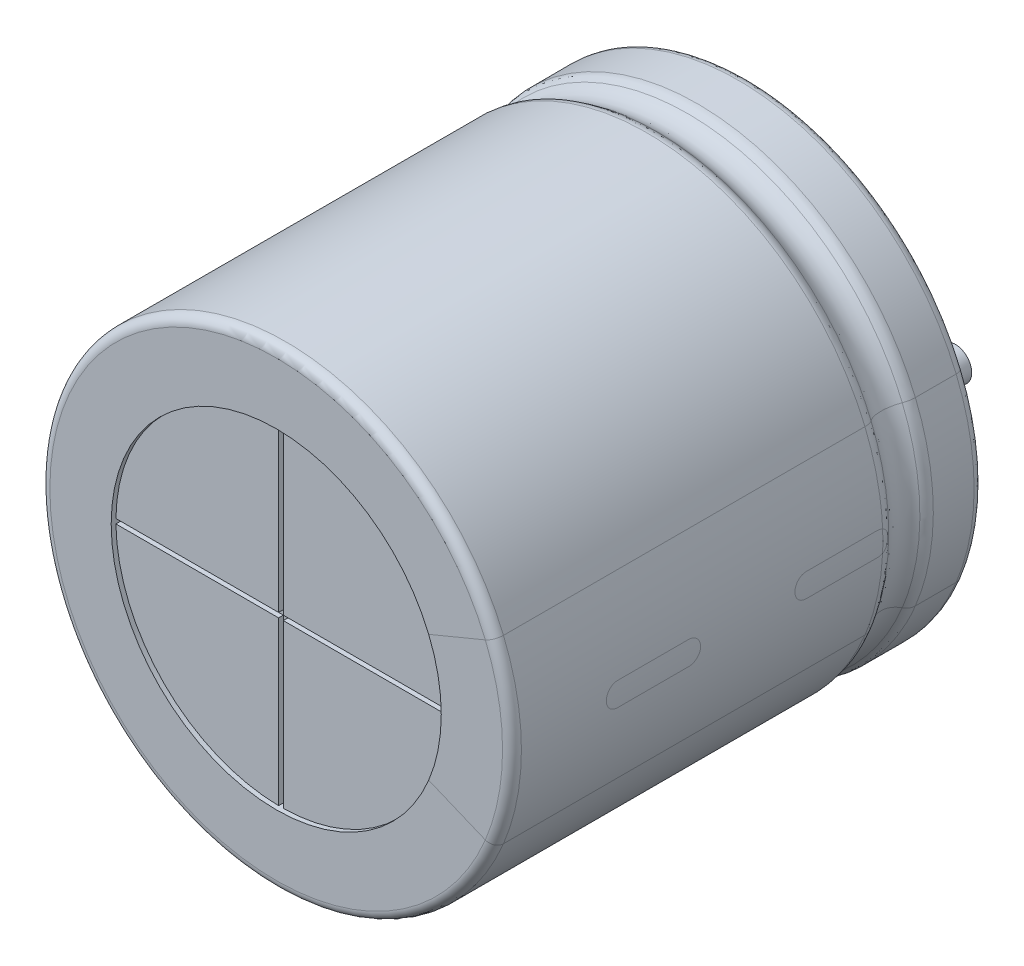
ISO-10303-21;
HEADER;
FILE_DESCRIPTION(('STEP AP214'),'2;1');
FILE_NAME('part.step','',(''),(''),'','','');
FILE_SCHEMA(('AUTOMOTIVE_DESIGN { 1 0 10303 214 1 1 1 1 }'));
ENDSEC;
DATA;
#1=APPLICATION_CONTEXT('core data for automotive mechanical design processes');
#2=APPLICATION_PROTOCOL_DEFINITION('international standard','automotive_design',2000,#1);
#3=PRODUCT_CONTEXT('',#1,'mechanical');
#4=PRODUCT('Part','Part','',(#3));
#5=PRODUCT_RELATED_PRODUCT_CATEGORY('part','',(#4));
#6=PRODUCT_DEFINITION_FORMATION('','',#4);
#7=PRODUCT_DEFINITION_CONTEXT('part definition',#1,'design');
#8=PRODUCT_DEFINITION('design','',#6,#7);
#9=PRODUCT_DEFINITION_SHAPE('','',#8);
#10=(LENGTH_UNIT() NAMED_UNIT(*) SI_UNIT(.MILLI.,.METRE.));
#11=(NAMED_UNIT(*) PLANE_ANGLE_UNIT() SI_UNIT($,.RADIAN.));
#12=(NAMED_UNIT(*) SI_UNIT($,.STERADIAN.) SOLID_ANGLE_UNIT());
#13=UNCERTAINTY_MEASURE_WITH_UNIT(LENGTH_MEASURE(1.E-05),#10,'distance_accuracy_value','');
#14=(GEOMETRIC_REPRESENTATION_CONTEXT(3) GLOBAL_UNCERTAINTY_ASSIGNED_CONTEXT((#13)) GLOBAL_UNIT_ASSIGNED_CONTEXT((#10,
#11,#12)) REPRESENTATION_CONTEXT('',''));
#15=CARTESIAN_POINT('',(0.,0.,0.));
#16=DIRECTION('',(0.,0.,1.));
#17=DIRECTION('',(1.,0.,0.));
#18=AXIS2_PLACEMENT_3D('',#15,#16,#17);
#19=CARTESIAN_POINT('',(2.55,-0.05,9.9));
#20=DIRECTION('',(0.,-1.,0.));
#21=DIRECTION('',(-1.,0.,0.));
#22=AXIS2_PLACEMENT_3D('',#19,#20,#21);
#23=PLANE('',#22);
#24=DIRECTION('',(0.,0.,-1.));
#25=VECTOR('',#24,1.);
#26=CARTESIAN_POINT('',(5.999642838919,-0.05,9.7));
#27=LINE('',#26,#25);
#28=CARTESIAN_POINT('',(5.999642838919,-0.05000000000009,9.9));
#29=VERTEX_POINT('',#28);
#30=CARTESIAN_POINT('',(5.999642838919,-0.05,9.8));
#31=VERTEX_POINT('',#30);
#32=EDGE_CURVE('E419',#29,#31,#27,.T.);
#33=ORIENTED_EDGE('',*,*,#32,.T.);
#34=DIRECTION('',(1.,0.,0.));
#35=VECTOR('',#34,1.);
#36=CARTESIAN_POINT('',(2.55,-0.05,9.8));
#37=LINE('',#36,#35);
#38=CARTESIAN_POINT('',(2.55,-0.05,9.8));
#39=VERTEX_POINT('',#38);
#40=EDGE_CURVE('E632',#39,#31,#37,.T.);
#41=ORIENTED_EDGE('',*,*,#40,.F.);
#42=DIRECTION('',(0.,0.,-1.));
#43=VECTOR('',#42,1.);
#44=CARTESIAN_POINT('',(2.55,-0.05,9.9));
#45=LINE('',#44,#43);
#46=CARTESIAN_POINT('',(2.55,-0.05,9.9));
#47=VERTEX_POINT('',#46);
#48=EDGE_CURVE('E718',#47,#39,#45,.T.);
#49=ORIENTED_EDGE('',*,*,#48,.F.);
#50=DIRECTION('',(1.,0.,0.));
#51=VECTOR('',#50,1.);
#52=CARTESIAN_POINT('',(2.55,-0.05,9.9));
#53=LINE('',#52,#51);
#54=EDGE_CURVE('E709',#47,#29,#53,.T.);
#55=ORIENTED_EDGE('',*,*,#54,.T.);
#56=EDGE_LOOP('',(#33,#41,#49,#55));
#57=FACE_BOUND('',#56,.T.);
#58=ADVANCED_FACE('F18',(#57),#23,.F.);
#59=CARTESIAN_POINT('',(12.55,0.05,9.9));
#60=DIRECTION('',(0.,1.,0.));
#61=DIRECTION('',(1.,0.,0.));
#62=AXIS2_PLACEMENT_3D('',#59,#60,#61);
#63=PLANE('',#62);
#64=DIRECTION('',(0.,0.,-1.));
#65=VECTOR('',#64,1.);
#66=CARTESIAN_POINT('',(2.55,0.05,9.9));
#67=LINE('',#66,#65);
#68=CARTESIAN_POINT('',(2.55,0.05,9.9));
#69=VERTEX_POINT('',#68);
#70=CARTESIAN_POINT('',(2.55,0.05,9.8));
#71=VERTEX_POINT('',#70);
#72=EDGE_CURVE('E668',#69,#71,#67,.T.);
#73=ORIENTED_EDGE('',*,*,#72,.T.);
#74=DIRECTION('',(-1.,0.,0.));
#75=VECTOR('',#74,1.);
#76=CARTESIAN_POINT('',(12.55,0.05,9.8));
#77=LINE('',#76,#75);
#78=CARTESIAN_POINT('',(5.999642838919,0.05,9.8));
#79=VERTEX_POINT('',#78);
#80=EDGE_CURVE('E627',#79,#71,#77,.T.);
#81=ORIENTED_EDGE('',*,*,#80,.F.);
#82=DIRECTION('',(0.,0.,-1.));
#83=VECTOR('',#82,1.);
#84=CARTESIAN_POINT('',(5.999642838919,0.05,9.7));
#85=LINE('',#84,#83);
#86=CARTESIAN_POINT('',(5.999642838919,0.05000000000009,9.9));
#87=VERTEX_POINT('',#86);
#88=EDGE_CURVE('E712',#87,#79,#85,.T.);
#89=ORIENTED_EDGE('',*,*,#88,.F.);
#90=DIRECTION('',(-1.,0.,0.));
#91=VECTOR('',#90,1.);
#92=CARTESIAN_POINT('',(12.55,0.05,9.9));
#93=LINE('',#92,#91);
#94=EDGE_CURVE('E458',#87,#69,#93,.T.);
#95=ORIENTED_EDGE('',*,*,#94,.T.);
#96=EDGE_LOOP('',(#73,#81,#89,#95));
#97=FACE_BOUND('',#96,.T.);
#98=ADVANCED_FACE('F1537',(#97),#63,.F.);
#99=CARTESIAN_POINT('',(2.45,0.05,9.9));
#100=DIRECTION('',(0.,1.,0.));
#101=DIRECTION('',(1.,0.,0.));
#102=AXIS2_PLACEMENT_3D('',#99,#100,#101);
#103=PLANE('',#102);
#104=DIRECTION('',(0.,0.,-1.));
#105=VECTOR('',#104,1.);
#106=CARTESIAN_POINT('',(-0.999642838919,0.05,9.7));
#107=LINE('',#106,#105);
#108=CARTESIAN_POINT('',(-0.999642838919,0.05000000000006,9.9));
#109=VERTEX_POINT('',#108);
#110=CARTESIAN_POINT('',(-0.999642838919,0.05,9.8));
#111=VERTEX_POINT('',#110);
#112=EDGE_CURVE('E689',#109,#111,#107,.T.);
#113=ORIENTED_EDGE('',*,*,#112,.T.);
#114=DIRECTION('',(-1.,0.,0.));
#115=VECTOR('',#114,1.);
#116=CARTESIAN_POINT('',(2.45,0.05,9.8));
#117=LINE('',#116,#115);
#118=CARTESIAN_POINT('',(2.45,0.05,9.8));
#119=VERTEX_POINT('',#118);
#120=EDGE_CURVE('E736',#119,#111,#117,.T.);
#121=ORIENTED_EDGE('',*,*,#120,.F.);
#122=DIRECTION('',(0.,0.,-1.));
#123=VECTOR('',#122,1.);
#124=CARTESIAN_POINT('',(2.45,0.05,9.9));
#125=LINE('',#124,#123);
#126=CARTESIAN_POINT('',(2.45,0.05,9.9));
#127=VERTEX_POINT('',#126);
#128=EDGE_CURVE('E418',#127,#119,#125,.T.);
#129=ORIENTED_EDGE('',*,*,#128,.F.);
#130=DIRECTION('',(-1.,0.,0.));
#131=VECTOR('',#130,1.);
#132=CARTESIAN_POINT('',(2.45,0.05,9.9));
#133=LINE('',#132,#131);
#134=EDGE_CURVE('E417',#127,#109,#133,.T.);
#135=ORIENTED_EDGE('',*,*,#134,.T.);
#136=EDGE_LOOP('',(#113,#121,#129,#135));
#137=FACE_BOUND('',#136,.T.);
#138=ADVANCED_FACE('F1532',(#137),#103,.F.);
#139=CARTESIAN_POINT('',(2.5,0.,9.9));
#140=DIRECTION('',(0.,0.,1.));
#141=DIRECTION('',(0.,-1.,0.));
#142=AXIS2_PLACEMENT_3D('',#139,#140,#141);
#143=PLANE('',#142);
#144=CARTESIAN_POINT('',(2.5,0.,9.9));
#145=DIRECTION('',(0.,0.,1.));
#146=DIRECTION('',(-1.,0.,0.));
#147=AXIS2_PLACEMENT_3D('',#144,#145,#146);
#148=CIRCLE('',#147,3.5);
#149=CARTESIAN_POINT('',(2.45,3.499642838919,9.9));
#150=VERTEX_POINT('',#149);
#151=EDGE_CURVE('E644',#150,#109,#148,.T.);
#152=ORIENTED_EDGE('',*,*,#151,.T.);
#153=ORIENTED_EDGE('',*,*,#134,.F.);
#154=DIRECTION('',(0.,-1.,0.));
#155=VECTOR('',#154,1.);
#156=CARTESIAN_POINT('',(2.45,10.05,9.9));
#157=LINE('',#156,#155);
#158=EDGE_CURVE('E413',#150,#127,#157,.T.);
#159=ORIENTED_EDGE('',*,*,#158,.F.);
#160=EDGE_LOOP('',(#152,#153,#159));
#161=FACE_BOUND('',#160,.T.);
#162=ADVANCED_FACE('F955',(#161),#143,.T.);
#163=CARTESIAN_POINT('',(-7.55,-0.05,9.9));
#164=DIRECTION('',(0.,-1.,0.));
#165=DIRECTION('',(-1.,0.,0.));
#166=AXIS2_PLACEMENT_3D('',#163,#164,#165);
#167=PLANE('',#166);
#168=DIRECTION('',(0.,0.,-1.));
#169=VECTOR('',#168,1.);
#170=CARTESIAN_POINT('',(2.45,-0.05,9.9));
#171=LINE('',#170,#169);
#172=CARTESIAN_POINT('',(2.45,-0.05,9.9));
#173=VERTEX_POINT('',#172);
#174=CARTESIAN_POINT('',(2.45,-0.05,9.8));
#175=VERTEX_POINT('',#174);
#176=EDGE_CURVE('E626',#173,#175,#171,.T.);
#177=ORIENTED_EDGE('',*,*,#176,.T.);
#178=DIRECTION('',(1.,0.,0.));
#179=VECTOR('',#178,1.);
#180=CARTESIAN_POINT('',(-7.55,-0.05,9.8));
#181=LINE('',#180,#179);
#182=CARTESIAN_POINT('',(-0.999642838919,-0.05,9.8));
#183=VERTEX_POINT('',#182);
#184=EDGE_CURVE('E450',#183,#175,#181,.T.);
#185=ORIENTED_EDGE('',*,*,#184,.F.);
#186=DIRECTION('',(0.,0.,-1.));
#187=VECTOR('',#186,1.);
#188=CARTESIAN_POINT('',(-0.999642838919,-0.05,9.7));
#189=LINE('',#188,#187);
#190=CARTESIAN_POINT('',(-0.999642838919,-0.05000000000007,9.9));
#191=VERTEX_POINT('',#190);
#192=EDGE_CURVE('E440',#191,#183,#189,.T.);
#193=ORIENTED_EDGE('',*,*,#192,.F.);
#194=DIRECTION('',(1.,0.,0.));
#195=VECTOR('',#194,1.);
#196=CARTESIAN_POINT('',(-7.55,-0.05,9.9));
#197=LINE('',#196,#195);
#198=EDGE_CURVE('E625',#191,#173,#197,.T.);
#199=ORIENTED_EDGE('',*,*,#198,.T.);
#200=EDGE_LOOP('',(#177,#185,#193,#199));
#201=FACE_BOUND('',#200,.T.);
#202=ADVANCED_FACE('F951',(#201),#167,.F.);
#203=CARTESIAN_POINT('',(2.45,10.05,9.9));
#204=DIRECTION('',(-1.,0.,0.));
#205=DIRECTION('',(0.,0.,1.));
#206=AXIS2_PLACEMENT_3D('',#203,#204,#205);
#207=PLANE('',#206);
#208=ORIENTED_EDGE('',*,*,#128,.T.);
#209=DIRECTION('',(0.,-1.,0.));
#210=VECTOR('',#209,1.);
#211=CARTESIAN_POINT('',(2.45,10.05,9.8));
#212=LINE('',#211,#210);
#213=CARTESIAN_POINT('',(2.45,3.499642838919,9.8));
#214=VERTEX_POINT('',#213);
#215=EDGE_CURVE('E732',#214,#119,#212,.T.);
#216=ORIENTED_EDGE('',*,*,#215,.F.);
#217=DIRECTION('',(0.,0.,-1.));
#218=VECTOR('',#217,1.);
#219=CARTESIAN_POINT('',(2.45,3.499642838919,9.7));
#220=LINE('',#219,#218);
#221=EDGE_CURVE('E504',#150,#214,#220,.T.);
#222=ORIENTED_EDGE('',*,*,#221,.F.);
#223=ORIENTED_EDGE('',*,*,#158,.T.);
#224=EDGE_LOOP('',(#208,#216,#222,#223));
#225=FACE_BOUND('',#224,.T.);
#226=ADVANCED_FACE('F954',(#225),#207,.F.);
#227=CARTESIAN_POINT('',(2.5,0.,9.9));
#228=DIRECTION('',(0.,0.,1.));
#229=DIRECTION('',(0.,-1.,0.));
#230=AXIS2_PLACEMENT_3D('',#227,#228,#229);
#231=PLANE('',#230);
#232=ORIENTED_EDGE('',*,*,#198,.F.);
#233=CARTESIAN_POINT('',(2.5,0.,9.9));
#234=DIRECTION('',(0.,0.,1.));
#235=DIRECTION('',(-1.,0.,0.));
#236=AXIS2_PLACEMENT_3D('',#233,#234,#235);
#237=CIRCLE('',#236,3.5);
#238=CARTESIAN_POINT('',(2.45,-3.499642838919,9.9));
#239=VERTEX_POINT('',#238);
#240=EDGE_CURVE('E433',#191,#239,#237,.T.);
#241=ORIENTED_EDGE('',*,*,#240,.T.);
#242=DIRECTION('',(0.,-1.,0.));
#243=VECTOR('',#242,1.);
#244=CARTESIAN_POINT('',(2.45,-0.05,9.9));
#245=LINE('',#244,#243);
#246=EDGE_CURVE('E622',#173,#239,#245,.T.);
#247=ORIENTED_EDGE('',*,*,#246,.F.);
#248=EDGE_LOOP('',(#232,#241,#247));
#249=FACE_BOUND('',#248,.T.);
#250=ADVANCED_FACE('F1197',(#249),#231,.T.);
#251=CARTESIAN_POINT('',(2.45,-0.05,9.9));
#252=DIRECTION('',(-1.,0.,0.));
#253=DIRECTION('',(0.,0.,1.));
#254=AXIS2_PLACEMENT_3D('',#251,#252,#253);
#255=PLANE('',#254);
#256=DIRECTION('',(0.,0.,-1.));
#257=VECTOR('',#256,1.);
#258=CARTESIAN_POINT('',(2.45,-3.499642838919,9.7));
#259=LINE('',#258,#257);
#260=CARTESIAN_POINT('',(2.45,-3.499642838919,9.8));
#261=VERTEX_POINT('',#260);
#262=EDGE_CURVE('E441',#239,#261,#259,.T.);
#263=ORIENTED_EDGE('',*,*,#262,.T.);
#264=DIRECTION('',(0.,-1.,0.));
#265=VECTOR('',#264,1.);
#266=CARTESIAN_POINT('',(2.45,-0.05,9.8));
#267=LINE('',#266,#265);
#268=EDGE_CURVE('E457',#175,#261,#267,.T.);
#269=ORIENTED_EDGE('',*,*,#268,.F.);
#270=ORIENTED_EDGE('',*,*,#176,.F.);
#271=ORIENTED_EDGE('',*,*,#246,.T.);
#272=EDGE_LOOP('',(#263,#269,#270,#271));
#273=FACE_BOUND('',#272,.T.);
#274=ADVANCED_FACE('F1557',(#273),#255,.F.);
#275=CARTESIAN_POINT('',(2.55,0.05,9.9));
#276=DIRECTION('',(1.,0.,0.));
#277=DIRECTION('',(0.,-1.,0.));
#278=AXIS2_PLACEMENT_3D('',#275,#276,#277);
#279=PLANE('',#278);
#280=DIRECTION('',(0.,0.,-1.));
#281=VECTOR('',#280,1.);
#282=CARTESIAN_POINT('',(2.55,3.499642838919,9.7));
#283=LINE('',#282,#281);
#284=CARTESIAN_POINT('',(2.55,3.499642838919,9.9));
#285=VERTEX_POINT('',#284);
#286=CARTESIAN_POINT('',(2.55,3.499642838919,9.8));
#287=VERTEX_POINT('',#286);
#288=EDGE_CURVE('E503',#285,#287,#283,.T.);
#289=ORIENTED_EDGE('',*,*,#288,.T.);
#290=DIRECTION('',(0.,1.,0.));
#291=VECTOR('',#290,1.);
#292=CARTESIAN_POINT('',(2.55,0.05,9.8));
#293=LINE('',#292,#291);
#294=EDGE_CURVE('E631',#71,#287,#293,.T.);
#295=ORIENTED_EDGE('',*,*,#294,.F.);
#296=ORIENTED_EDGE('',*,*,#72,.F.);
#297=DIRECTION('',(0.,1.,0.));
#298=VECTOR('',#297,1.);
#299=CARTESIAN_POINT('',(2.55,0.05,9.9));
#300=LINE('',#299,#298);
#301=EDGE_CURVE('E637',#69,#285,#300,.T.);
#302=ORIENTED_EDGE('',*,*,#301,.T.);
#303=EDGE_LOOP('',(#289,#295,#296,#302));
#304=FACE_BOUND('',#303,.T.);
#305=ADVANCED_FACE('F1401',(#304),#279,.F.);
#306=CARTESIAN_POINT('',(2.5,0.,9.8));
#307=DIRECTION('',(0.,0.,1.));
#308=DIRECTION('',(1.,0.,0.));
#309=AXIS2_PLACEMENT_3D('',#306,#307,#308);
#310=PLANE('',#309);
#311=ORIENTED_EDGE('',*,*,#184,.T.);
#312=ORIENTED_EDGE('',*,*,#268,.T.);
#313=CARTESIAN_POINT('',(2.5,0.,9.8));
#314=DIRECTION('',(0.,0.,-1.));
#315=DIRECTION('',(-1.,0.,0.));
#316=AXIS2_PLACEMENT_3D('',#313,#314,#315);
#317=CIRCLE('',#316,3.5);
#318=CARTESIAN_POINT('',(2.55,-3.499642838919,9.8));
#319=VERTEX_POINT('',#318);
#320=EDGE_CURVE('E679',#319,#261,#317,.T.);
#321=ORIENTED_EDGE('',*,*,#320,.F.);
#322=DIRECTION('',(0.,1.,0.));
#323=VECTOR('',#322,1.);
#324=CARTESIAN_POINT('',(2.55,-10.05,9.8));
#325=LINE('',#324,#323);
#326=EDGE_CURVE('E640',#319,#39,#325,.T.);
#327=ORIENTED_EDGE('',*,*,#326,.T.);
#328=ORIENTED_EDGE('',*,*,#40,.T.);
#329=CARTESIAN_POINT('',(2.5,0.,9.8));
#330=DIRECTION('',(0.,0.,-1.));
#331=DIRECTION('',(-1.,0.,0.));
#332=AXIS2_PLACEMENT_3D('',#329,#330,#331);
#333=CIRCLE('',#332,3.5);
#334=EDGE_CURVE('E424',#79,#31,#333,.T.);
#335=ORIENTED_EDGE('',*,*,#334,.F.);
#336=ORIENTED_EDGE('',*,*,#80,.T.);
#337=ORIENTED_EDGE('',*,*,#294,.T.);
#338=CARTESIAN_POINT('',(2.5,0.,9.8));
#339=DIRECTION('',(0.,0.,-1.));
#340=DIRECTION('',(-1.,0.,0.));
#341=AXIS2_PLACEMENT_3D('',#338,#339,#340);
#342=CIRCLE('',#341,3.5);
#343=EDGE_CURVE('E499',#214,#287,#342,.T.);
#344=ORIENTED_EDGE('',*,*,#343,.F.);
#345=ORIENTED_EDGE('',*,*,#215,.T.);
#346=ORIENTED_EDGE('',*,*,#120,.T.);
#347=CARTESIAN_POINT('',(2.5,0.,9.8));
#348=DIRECTION('',(0.,0.,-1.));
#349=DIRECTION('',(-1.,0.,0.));
#350=AXIS2_PLACEMENT_3D('',#347,#348,#349);
#351=CIRCLE('',#350,3.5);
#352=CARTESIAN_POINT('',(-1.,0.,9.8));
#353=VERTEX_POINT('',#352);
#354=EDGE_CURVE('E559',#353,#111,#351,.T.);
#355=ORIENTED_EDGE('',*,*,#354,.F.);
#356=CARTESIAN_POINT('',(2.5,0.,9.8));
#357=DIRECTION('',(0.,0.,-1.));
#358=DIRECTION('',(-1.,0.,0.));
#359=AXIS2_PLACEMENT_3D('',#356,#357,#358);
#360=CIRCLE('',#359,3.5);
#361=EDGE_CURVE('E555',#183,#353,#360,.T.);
#362=ORIENTED_EDGE('',*,*,#361,.F.);
#363=EDGE_LOOP('',(#311,#312,#321,#327,#328,#335,#336,#337,#344,#345,#346,#355,#362));
#364=FACE_BOUND('',#363,.T.);
#365=ADVANCED_FACE('F853',(#364),#310,.T.);
#366=CARTESIAN_POINT('',(2.5,0.,9.9));
#367=DIRECTION('',(0.,0.,1.));
#368=DIRECTION('',(0.,-1.,0.));
#369=AXIS2_PLACEMENT_3D('',#366,#367,#368);
#370=PLANE('',#369);
#371=CARTESIAN_POINT('',(2.5,0.,9.9));
#372=DIRECTION('',(0.,0.,1.));
#373=DIRECTION('',(-1.,0.,0.));
#374=AXIS2_PLACEMENT_3D('',#371,#372,#373);
#375=CIRCLE('',#374,3.5);
#376=CARTESIAN_POINT('',(5.73357836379,1.339392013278,9.9));
#377=VERTEX_POINT('',#376);
#378=EDGE_CURVE('E705',#87,#377,#375,.T.);
#379=ORIENTED_EDGE('',*,*,#378,.T.);
#380=CARTESIAN_POINT('',(2.5,0.,9.9));
#381=DIRECTION('',(0.,0.,1.));
#382=DIRECTION('',(-1.,0.,0.));
#383=AXIS2_PLACEMENT_3D('',#380,#381,#382);
#384=CIRCLE('',#383,3.5);
#385=EDGE_CURVE('E695',#377,#285,#384,.T.);
#386=ORIENTED_EDGE('',*,*,#385,.T.);
#387=ORIENTED_EDGE('',*,*,#301,.F.);
#388=ORIENTED_EDGE('',*,*,#94,.F.);
#389=EDGE_LOOP('',(#379,#386,#387,#388));
#390=FACE_BOUND('',#389,.T.);
#391=ADVANCED_FACE('F1400',(#390),#370,.T.);
#392=CARTESIAN_POINT('',(2.55,-10.05,9.9));
#393=DIRECTION('',(1.,0.,0.));
#394=DIRECTION('',(0.,-1.,0.));
#395=AXIS2_PLACEMENT_3D('',#392,#393,#394);
#396=PLANE('',#395);
#397=ORIENTED_EDGE('',*,*,#48,.T.);
#398=ORIENTED_EDGE('',*,*,#326,.F.);
#399=DIRECTION('',(0.,0.,-1.));
#400=VECTOR('',#399,1.);
#401=CARTESIAN_POINT('',(2.55,-3.499642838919,9.7));
#402=LINE('',#401,#400);
#403=CARTESIAN_POINT('',(2.55,-3.499642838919,9.9));
#404=VERTEX_POINT('',#403);
#405=EDGE_CURVE('E672',#404,#319,#402,.T.);
#406=ORIENTED_EDGE('',*,*,#405,.F.);
#407=DIRECTION('',(0.,1.,0.));
#408=VECTOR('',#407,1.);
#409=CARTESIAN_POINT('',(2.55,-10.05,9.9));
#410=LINE('',#409,#408);
#411=EDGE_CURVE('E582',#404,#47,#410,.T.);
#412=ORIENTED_EDGE('',*,*,#411,.T.);
#413=EDGE_LOOP('',(#397,#398,#406,#412));
#414=FACE_BOUND('',#413,.T.);
#415=ADVANCED_FACE('F1512',(#414),#396,.F.);
#416=CARTESIAN_POINT('',(2.5,0.,9.9));
#417=DIRECTION('',(0.,0.,1.));
#418=DIRECTION('',(0.,-1.,0.));
#419=AXIS2_PLACEMENT_3D('',#416,#417,#418);
#420=PLANE('',#419);
#421=ORIENTED_EDGE('',*,*,#411,.F.);
#422=CARTESIAN_POINT('',(2.5,0.,9.9));
#423=DIRECTION('',(0.,0.,1.));
#424=DIRECTION('',(-1.,0.,0.));
#425=AXIS2_PLACEMENT_3D('',#422,#423,#424);
#426=CIRCLE('',#425,3.5);
#427=CARTESIAN_POINT('',(5.73357836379,-1.339392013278,9.9));
#428=VERTEX_POINT('',#427);
#429=EDGE_CURVE('E661',#404,#428,#426,.T.);
#430=ORIENTED_EDGE('',*,*,#429,.T.);
#431=CARTESIAN_POINT('',(2.5,0.,9.9));
#432=DIRECTION('',(0.,0.,1.));
#433=DIRECTION('',(-1.,0.,0.));
#434=AXIS2_PLACEMENT_3D('',#431,#432,#433);
#435=CIRCLE('',#434,3.5);
#436=EDGE_CURVE('E423',#428,#29,#435,.T.);
#437=ORIENTED_EDGE('',*,*,#436,.T.);
#438=ORIENTED_EDGE('',*,*,#54,.F.);
#439=EDGE_LOOP('',(#421,#430,#437,#438));
#440=FACE_BOUND('',#439,.T.);
#441=ADVANCED_FACE('F1503',(#440),#420,.T.);
#442=CARTESIAN_POINT('',(2.5,0.,10.));
#443=DIRECTION('',(0.,0.,-1.));
#444=DIRECTION('',(0.923879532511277,0.382683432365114,0.));
#445=AXIS2_PLACEMENT_3D('',#442,#443,#444);
#446=CYLINDRICAL_SURFACE('',#445,3.5);
#447=ORIENTED_EDGE('',*,*,#378,.F.);
#448=ORIENTED_EDGE('',*,*,#88,.T.);
#449=ORIENTED_EDGE('',*,*,#334,.T.);
#450=ORIENTED_EDGE('',*,*,#32,.F.);
#451=ORIENTED_EDGE('',*,*,#436,.F.);
#452=DIRECTION('',(0.,0.,-1.));
#453=VECTOR('',#452,1.);
#454=CARTESIAN_POINT('',(5.73357836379,-1.339392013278,10.));
#455=LINE('',#454,#453);
#456=CARTESIAN_POINT('',(5.73357836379,-1.339392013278,10.));
#457=VERTEX_POINT('',#456);
#458=EDGE_CURVE('E701',#457,#428,#455,.T.);
#459=ORIENTED_EDGE('',*,*,#458,.F.);
#460=CARTESIAN_POINT('',(2.5,0.,10.));
#461=DIRECTION('',(0.,0.,-1.));
#462=DIRECTION('',(0.923879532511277,0.382683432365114,0.));
#463=AXIS2_PLACEMENT_3D('',#460,#461,#462);
#464=CIRCLE('',#463,3.5);
#465=CARTESIAN_POINT('',(5.73357836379,1.339392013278,10.));
#466=VERTEX_POINT('',#465);
#467=EDGE_CURVE('E657',#466,#457,#464,.T.);
#468=ORIENTED_EDGE('',*,*,#467,.F.);
#469=DIRECTION('',(0.,0.,-1.));
#470=VECTOR('',#469,1.);
#471=CARTESIAN_POINT('',(5.73357836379,1.339392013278,10.));
#472=LINE('',#471,#470);
#473=EDGE_CURVE('E700',#466,#377,#472,.T.);
#474=ORIENTED_EDGE('',*,*,#473,.T.);
#475=EDGE_LOOP('',(#447,#448,#449,#450,#451,#459,#468,#474));
#476=FACE_BOUND('',#475,.T.);
#477=ADVANCED_FACE('F1491',(#476),#446,.F.);
#478=CARTESIAN_POINT('',(2.5,0.,10.));
#479=DIRECTION('',(0.,0.,-1.));
#480=DIRECTION('',(0.923879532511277,-0.382683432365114,0.));
#481=AXIS2_PLACEMENT_3D('',#478,#479,#480);
#482=CYLINDRICAL_SURFACE('',#481,3.5);
#483=ORIENTED_EDGE('',*,*,#429,.F.);
#484=ORIENTED_EDGE('',*,*,#405,.T.);
#485=ORIENTED_EDGE('',*,*,#320,.T.);
#486=ORIENTED_EDGE('',*,*,#262,.F.);
#487=ORIENTED_EDGE('',*,*,#240,.F.);
#488=ORIENTED_EDGE('',*,*,#192,.T.);
#489=ORIENTED_EDGE('',*,*,#361,.T.);
#490=ORIENTED_EDGE('',*,*,#354,.T.);
#491=ORIENTED_EDGE('',*,*,#112,.F.);
#492=ORIENTED_EDGE('',*,*,#151,.F.);
#493=ORIENTED_EDGE('',*,*,#221,.T.);
#494=ORIENTED_EDGE('',*,*,#343,.T.);
#495=ORIENTED_EDGE('',*,*,#288,.F.);
#496=ORIENTED_EDGE('',*,*,#385,.F.);
#497=ORIENTED_EDGE('',*,*,#473,.F.);
#498=CARTESIAN_POINT('',(2.5,0.,10.));
#499=DIRECTION('',(0.,0.,-1.));
#500=DIRECTION('',(0.923879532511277,-0.382683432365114,0.));
#501=AXIS2_PLACEMENT_3D('',#498,#499,#500);
#502=CIRCLE('',#501,3.5);
#503=EDGE_CURVE('E656',#457,#466,#502,.T.);
#504=ORIENTED_EDGE('',*,*,#503,.F.);
#505=ORIENTED_EDGE('',*,*,#458,.T.);
#506=EDGE_LOOP('',(#483,#484,#485,#486,#487,#488,#489,#490,#491,#492,#493,#494,#495,#496,#497,
#504,#505));
#507=FACE_BOUND('',#506,.T.);
#508=ADVANCED_FACE('F1479',(#507),#482,.F.);
#509=CARTESIAN_POINT('',(2.5,0.,10.));
#510=DIRECTION('',(0.,0.,-1.));
#511=DIRECTION('',(0.,-1.,0.));
#512=AXIS2_PLACEMENT_3D('',#509,#510,#511);
#513=PLANE('',#512);
#514=DIRECTION('',(-0.923879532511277,-0.382683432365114,0.));
#515=VECTOR('',#514,1.);
#516=CARTESIAN_POINT('',(6.934621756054,1.836880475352,10.));
#517=LINE('',#516,#515);
#518=CARTESIAN_POINT('',(6.934621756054,1.836880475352,10.));
#519=VERTEX_POINT('',#518);
#520=EDGE_CURVE('E662',#519,#466,#517,.T.);
#521=ORIENTED_EDGE('',*,*,#520,.T.);
#522=ORIENTED_EDGE('',*,*,#467,.T.);
#523=DIRECTION('',(-0.923879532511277,0.382683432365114,0.));
#524=VECTOR('',#523,1.);
#525=CARTESIAN_POINT('',(6.934621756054,-1.836880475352,10.));
#526=LINE('',#525,#524);
#527=CARTESIAN_POINT('',(6.934621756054,-1.836880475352,10.));
#528=VERTEX_POINT('',#527);
#529=EDGE_CURVE('E652',#528,#457,#526,.T.);
#530=ORIENTED_EDGE('',*,*,#529,.F.);
#531=CARTESIAN_POINT('',(2.5,0.,10.));
#532=DIRECTION('',(0.,0.,-1.));
#533=DIRECTION('',(0.923879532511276,0.382683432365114,0.));
#534=AXIS2_PLACEMENT_3D('',#531,#532,#533);
#535=CIRCLE('',#534,4.8);
#536=EDGE_CURVE('E648',#519,#528,#535,.T.);
#537=ORIENTED_EDGE('',*,*,#536,.F.);
#538=EDGE_LOOP('',(#521,#522,#530,#537));
#539=FACE_BOUND('',#538,.T.);
#540=ADVANCED_FACE('F1467',(#539),#513,.F.);
#541=CARTESIAN_POINT('',(2.5,0.,10.));
#542=DIRECTION('',(0.,0.,-1.));
#543=DIRECTION('',(0.,-1.,0.));
#544=AXIS2_PLACEMENT_3D('',#541,#542,#543);
#545=PLANE('',#544);
#546=ORIENTED_EDGE('',*,*,#529,.T.);
#547=ORIENTED_EDGE('',*,*,#503,.T.);
#548=ORIENTED_EDGE('',*,*,#520,.F.);
#549=CARTESIAN_POINT('',(2.5,0.,10.));
#550=DIRECTION('',(0.,0.,-1.));
#551=DIRECTION('',(0.923879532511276,-0.382683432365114,0.));
#552=AXIS2_PLACEMENT_3D('',#549,#550,#551);
#553=CIRCLE('',#552,4.8);
#554=EDGE_CURVE('E621',#528,#519,#553,.T.);
#555=ORIENTED_EDGE('',*,*,#554,.F.);
#556=EDGE_LOOP('',(#546,#547,#548,#555));
#557=FACE_BOUND('',#556,.T.);
#558=ADVANCED_FACE('F1455',(#557),#545,.F.);
#559=CARTESIAN_POINT('',(2.5,0.,2.));
#560=DIRECTION('',(0.,0.,1.));
#561=DIRECTION('',(0.923879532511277,0.382683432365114,0.));
#562=AXIS2_PLACEMENT_3D('',#559,#560,#561);
#563=CYLINDRICAL_SURFACE('',#562,5.);
#564=CARTESIAN_POINT('',(7.49374608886,0.25,7.751));
#565=CARTESIAN_POINT('',(7.49374608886,0.25,7.796830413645));
#566=CARTESIAN_POINT('',(7.494228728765,0.240360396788,7.843180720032));
#567=CARTESIAN_POINT('',(7.495213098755,0.220691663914,7.887697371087));
#568=CARTESIAN_POINT('',(7.496580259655,0.191310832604,7.927965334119));
#569=CARTESIAN_POINT('',(7.498059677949,0.152970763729,7.961648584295));
#570=CARTESIAN_POINT('',(7.499302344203,0.107059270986,7.986419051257));
#571=CARTESIAN_POINT('',(7.499989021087,0.05539456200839,8.));
#572=CARTESIAN_POINT('',(7.4999999,0.001000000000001,8.));
#573=(BOUNDED_CURVE() B_SPLINE_CURVE(8,(#564,#565,#566,#567,#568,#569,#570,#571,#572),
.UNSPECIFIED.,.F.,.F.) B_SPLINE_CURVE_WITH_KNOTS((9,9),(0.,1.),
.UNSPECIFIED.) CURVE() GEOMETRIC_REPRESENTATION_ITEM() RATIONAL_B_SPLINE_CURVE((1.,1.,1.,1.,1.,
1.,1.,1.,1.)) REPRESENTATION_ITEM(''));
#574=CARTESIAN_POINT('',(7.49374608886,0.25,7.751));
#575=VERTEX_POINT('',#574);
#576=CARTESIAN_POINT('',(7.4999999,0.0009999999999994,8.));
#577=VERTEX_POINT('',#576);
#578=EDGE_CURVE('E585',#575,#577,#573,.T.);
#579=ORIENTED_EDGE('',*,*,#578,.T.);
#580=CARTESIAN_POINT('',(2.5,0.,8.));
#581=DIRECTION('',(0.,0.,1.));
#582=DIRECTION('',(0.923879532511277,0.382683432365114,0.));
#583=AXIS2_PLACEMENT_3D('',#580,#581,#582);
#584=CIRCLE('',#583,5.);
#585=CARTESIAN_POINT('',(7.4999999,-0.001000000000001,8.));
#586=VERTEX_POINT('',#585);
#587=EDGE_CURVE('E480',#586,#577,#584,.T.);
#588=ORIENTED_EDGE('',*,*,#587,.F.);
#589=CARTESIAN_POINT('',(7.4999999,-0.001000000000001,8.));
#590=CARTESIAN_POINT('',(7.499989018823,-0.05540588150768,8.));
#591=CARTESIAN_POINT('',(7.499302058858,-0.107073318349,7.986413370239));
#592=CARTESIAN_POINT('',(7.498059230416,-0.152979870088,7.961639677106));
#593=CARTESIAN_POINT('',(7.496580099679,-0.191312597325,7.927958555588));
#594=CARTESIAN_POINT('',(7.495213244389,-0.220688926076,7.887697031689));
#595=CARTESIAN_POINT('',(7.494228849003,-0.240357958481,7.843186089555));
#596=CARTESIAN_POINT('',(7.49374608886,-0.25,7.796836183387));
#597=CARTESIAN_POINT('',(7.49374608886,-0.25,7.751));
#598=(BOUNDED_CURVE() B_SPLINE_CURVE(8,(#589,#590,#591,#592,#593,#594,#595,#596,#597),
.UNSPECIFIED.,.F.,.F.) B_SPLINE_CURVE_WITH_KNOTS((9,9),(0.,1.),
.UNSPECIFIED.) CURVE() GEOMETRIC_REPRESENTATION_ITEM() RATIONAL_B_SPLINE_CURVE((1.,1.,1.,1.,1.,
1.,1.,1.,1.)) REPRESENTATION_ITEM(''));
#599=CARTESIAN_POINT('',(7.49374608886,-0.25,7.751));
#600=VERTEX_POINT('',#599);
#601=EDGE_CURVE('E475',#586,#600,#598,.T.);
#602=ORIENTED_EDGE('',*,*,#601,.T.);
#603=DIRECTION('',(0.,0.,1.));
#604=VECTOR('',#603,1.);
#605=CARTESIAN_POINT('',(7.49374608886,-0.25,2.));
#606=LINE('',#605,#604);
#607=CARTESIAN_POINT('',(7.49374608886,-0.25,6.249));
#608=VERTEX_POINT('',#607);
#609=EDGE_CURVE('E481',#608,#600,#606,.T.);
#610=ORIENTED_EDGE('',*,*,#609,.F.);
#611=CARTESIAN_POINT('',(7.4999999,-0.001000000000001,6.));
#612=CARTESIAN_POINT('',(7.499989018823,-0.05540588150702,6.));
#613=CARTESIAN_POINT('',(7.499302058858,-0.10707331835,6.013586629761));
#614=CARTESIAN_POINT('',(7.498059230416,-0.152979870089,6.038360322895));
#615=CARTESIAN_POINT('',(7.49658009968,-0.191312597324,6.072041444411));
#616=CARTESIAN_POINT('',(7.495213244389,-0.220688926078,6.112302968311));
#617=CARTESIAN_POINT('',(7.494228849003,-0.24035795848,6.156813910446));
#618=CARTESIAN_POINT('',(7.49374608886,-0.25,6.203163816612));
#619=CARTESIAN_POINT('',(7.49374608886,-0.25,6.249));
#620=(BOUNDED_CURVE() B_SPLINE_CURVE(8,(#611,#612,#613,#614,#615,#616,#617,#618,#619),
.UNSPECIFIED.,.F.,.F.) B_SPLINE_CURVE_WITH_KNOTS((9,9),(0.,1.),
.UNSPECIFIED.) CURVE() GEOMETRIC_REPRESENTATION_ITEM() RATIONAL_B_SPLINE_CURVE((1.,1.,1.,1.,1.,
1.,1.,1.,1.)) REPRESENTATION_ITEM(''));
#621=CARTESIAN_POINT('',(7.4999999,-0.001000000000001,6.));
#622=VERTEX_POINT('',#621);
#623=EDGE_CURVE('E560',#622,#608,#620,.T.);
#624=ORIENTED_EDGE('',*,*,#623,.F.);
#625=CARTESIAN_POINT('',(2.5,0.,6.));
#626=DIRECTION('',(0.,0.,1.));
#627=DIRECTION('',(0.923879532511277,0.382683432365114,0.));
#628=AXIS2_PLACEMENT_3D('',#625,#626,#627);
#629=CIRCLE('',#628,5.);
#630=CARTESIAN_POINT('',(7.4999999,0.0009999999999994,6.));
#631=VERTEX_POINT('',#630);
#632=EDGE_CURVE('E465',#622,#631,#629,.T.);
#633=ORIENTED_EDGE('',*,*,#632,.T.);
#634=CARTESIAN_POINT('',(7.49374608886,0.25,6.249));
#635=CARTESIAN_POINT('',(7.49374608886,0.25,6.203169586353));
#636=CARTESIAN_POINT('',(7.494228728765,0.240360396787,6.156819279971));
#637=CARTESIAN_POINT('',(7.495213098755,0.220691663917,6.112302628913));
#638=CARTESIAN_POINT('',(7.496580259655,0.1913108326,6.072034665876));
#639=CARTESIAN_POINT('',(7.498059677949,0.15297076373,6.03835141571));
#640=CARTESIAN_POINT('',(7.499302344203,0.10705927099,6.013580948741));
#641=CARTESIAN_POINT('',(7.499989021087,0.05539456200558,6.));
#642=CARTESIAN_POINT('',(7.4999999,0.001000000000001,6.));
#643=(BOUNDED_CURVE() B_SPLINE_CURVE(8,(#634,#635,#636,#637,#638,#639,#640,#641,#642),
.UNSPECIFIED.,.F.,.F.) B_SPLINE_CURVE_WITH_KNOTS((9,9),(0.,1.),
.UNSPECIFIED.) CURVE() GEOMETRIC_REPRESENTATION_ITEM() RATIONAL_B_SPLINE_CURVE((1.,1.,1.,1.,1.,
1.,1.,1.,1.)) REPRESENTATION_ITEM(''));
#644=CARTESIAN_POINT('',(7.49374608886,0.25,6.249));
#645=VERTEX_POINT('',#644);
#646=EDGE_CURVE('E459',#645,#631,#643,.T.);
#647=ORIENTED_EDGE('',*,*,#646,.F.);
#648=DIRECTION('',(0.,0.,1.));
#649=VECTOR('',#648,1.);
#650=CARTESIAN_POINT('',(7.49374608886,0.25,2.));
#651=LINE('',#650,#649);
#652=EDGE_CURVE('E466',#645,#575,#651,.T.);
#653=ORIENTED_EDGE('',*,*,#652,.T.);
#654=EDGE_LOOP('',(#579,#588,#602,#610,#624,#633,#647,#653));
#655=FACE_BOUND('',#654,.T.);
#656=ADVANCED_FACE('F1443',(#655),#563,.T.);
#657=CARTESIAN_POINT('',(2.5,0.,2.));
#658=DIRECTION('',(0.,0.,1.));
#659=DIRECTION('',(0.923879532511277,0.382683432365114,0.));
#660=AXIS2_PLACEMENT_3D('',#657,#658,#659);
#661=CYLINDRICAL_SURFACE('',#660,5.);
#662=DIRECTION('',(0.,0.,1.));
#663=VECTOR('',#662,1.);
#664=CARTESIAN_POINT('',(7.49374608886,0.25,2.));
#665=LINE('',#664,#663);
#666=CARTESIAN_POINT('',(7.49374608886,0.25,2.249));
#667=VERTEX_POINT('',#666);
#668=CARTESIAN_POINT('',(7.49374608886,0.25,3.751));
#669=VERTEX_POINT('',#668);
#670=EDGE_CURVE('E491',#667,#669,#665,.T.);
#671=ORIENTED_EDGE('',*,*,#670,.T.);
#672=CARTESIAN_POINT('',(7.49374608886,0.25,3.751));
#673=CARTESIAN_POINT('',(7.49374608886,0.25,3.796830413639));
#674=CARTESIAN_POINT('',(7.494228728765,0.24036039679,3.843180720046));
#675=CARTESIAN_POINT('',(7.495213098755,0.220691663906,3.887697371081));
#676=CARTESIAN_POINT('',(7.496580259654,0.191310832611,3.927965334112));
#677=CARTESIAN_POINT('',(7.49805967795,0.152970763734,3.961648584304));
#678=CARTESIAN_POINT('',(7.499302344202,0.107059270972,3.986419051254));
#679=CARTESIAN_POINT('',(7.499989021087,0.05539456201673,4.));
#680=CARTESIAN_POINT('',(7.4999999,0.001000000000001,4.));
#681=(BOUNDED_CURVE() B_SPLINE_CURVE(8,(#672,#673,#674,#675,#676,#677,#678,#679,#680),
.UNSPECIFIED.,.F.,.F.) B_SPLINE_CURVE_WITH_KNOTS((9,9),(0.,1.),
.UNSPECIFIED.) CURVE() GEOMETRIC_REPRESENTATION_ITEM() RATIONAL_B_SPLINE_CURVE((1.,1.,1.,1.,1.,
1.,1.,1.,1.)) REPRESENTATION_ITEM(''));
#682=CARTESIAN_POINT('',(7.4999999,0.0009999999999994,4.));
#683=VERTEX_POINT('',#682);
#684=EDGE_CURVE('E498',#669,#683,#681,.T.);
#685=ORIENTED_EDGE('',*,*,#684,.T.);
#686=CARTESIAN_POINT('',(2.5,0.,4.));
#687=DIRECTION('',(0.,0.,1.));
#688=DIRECTION('',(0.923879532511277,0.382683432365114,0.));
#689=AXIS2_PLACEMENT_3D('',#686,#687,#688);
#690=CIRCLE('',#689,5.);
#691=CARTESIAN_POINT('',(7.4999999,-0.001000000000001,4.));
#692=VERTEX_POINT('',#691);
#693=EDGE_CURVE('E404',#692,#683,#690,.T.);
#694=ORIENTED_EDGE('',*,*,#693,.F.);
#695=CARTESIAN_POINT('',(7.4999999,-0.001000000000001,4.));
#696=CARTESIAN_POINT('',(7.499989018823,-0.05540588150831,4.));
#697=CARTESIAN_POINT('',(7.499302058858,-0.107073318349,3.986413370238));
#698=CARTESIAN_POINT('',(7.498059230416,-0.152979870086,3.961639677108));
#699=CARTESIAN_POINT('',(7.496580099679,-0.191312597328,3.927958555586));
#700=CARTESIAN_POINT('',(7.495213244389,-0.220688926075,3.887697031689));
#701=CARTESIAN_POINT('',(7.494228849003,-0.240357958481,3.843186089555));
#702=CARTESIAN_POINT('',(7.49374608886,-0.25,3.796836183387));
#703=CARTESIAN_POINT('',(7.49374608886,-0.25,3.751));
#704=(BOUNDED_CURVE() B_SPLINE_CURVE(8,(#695,#696,#697,#698,#699,#700,#701,#702,#703),
.UNSPECIFIED.,.F.,.F.) B_SPLINE_CURVE_WITH_KNOTS((9,9),(0.,1.),
.UNSPECIFIED.) CURVE() GEOMETRIC_REPRESENTATION_ITEM() RATIONAL_B_SPLINE_CURVE((1.,1.,1.,1.,1.,
1.,1.,1.,1.)) REPRESENTATION_ITEM(''));
#705=CARTESIAN_POINT('',(7.49374608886,-0.25,3.751));
#706=VERTEX_POINT('',#705);
#707=EDGE_CURVE('E399',#692,#706,#704,.T.);
#708=ORIENTED_EDGE('',*,*,#707,.T.);
#709=DIRECTION('',(0.,0.,1.));
#710=VECTOR('',#709,1.);
#711=CARTESIAN_POINT('',(7.49374608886,-0.25,2.));
#712=LINE('',#711,#710);
#713=CARTESIAN_POINT('',(7.49374608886,-0.25,2.249));
#714=VERTEX_POINT('',#713);
#715=EDGE_CURVE('E405',#714,#706,#712,.T.);
#716=ORIENTED_EDGE('',*,*,#715,.F.);
#717=CARTESIAN_POINT('',(7.495052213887,-0.222381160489,2.135020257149));
#718=CARTESIAN_POINT('',(7.494563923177,-0.23334898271,2.156322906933));
#719=CARTESIAN_POINT('',(7.494163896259,-0.241656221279,2.178754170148));
#720=CARTESIAN_POINT('',(7.493885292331,-0.247218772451,2.201923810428));
#721=CARTESIAN_POINT('',(7.49374608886,-0.25,2.225463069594));
#722=CARTESIAN_POINT('',(7.49374608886,-0.25,2.249));
#723=(BOUNDED_CURVE() B_SPLINE_CURVE(5,(#717,#718,#719,#720,#721,#722),.UNSPECIFIED.,.F.,
.F.) B_SPLINE_CURVE_WITH_KNOTS((6,6),(0.,1.),
.UNSPECIFIED.) CURVE() GEOMETRIC_REPRESENTATION_ITEM() RATIONAL_B_SPLINE_CURVE((1.,1.,1.,1.,1.,1.)) REPRESENTATION_ITEM(''));
#724=CARTESIAN_POINT('',(7.495050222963,-0.222381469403,2.135020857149));
#725=VERTEX_POINT('',#724);
#726=EDGE_CURVE('E412',#725,#714,#723,.T.);
#727=ORIENTED_EDGE('',*,*,#726,.F.);
#728=CARTESIAN_POINT('',(7.02800265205,2.134064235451,2.135020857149));
#729=CARTESIAN_POINT('',(7.046281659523,2.089934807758,2.135020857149));
#730=CARTESIAN_POINT('',(7.064560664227,2.04580538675,2.135020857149));
#731=CARTESIAN_POINT('',(7.082839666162,2.001675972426,2.135020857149));
#732=CARTESIAN_POINT('',(7.101118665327,1.957546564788,2.135020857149));
#733=CARTESIAN_POINT('',(7.41995647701,1.187803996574,2.135020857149));
#734=CARTESIAN_POINT('',(7.578077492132,0.403182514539,2.135020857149));
#735=CARTESIAN_POINT('',(7.578078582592,-0.403179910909,2.135020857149));
#736=CARTESIAN_POINT('',(7.41995703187,-1.187802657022,2.135020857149));
#737=CARTESIAN_POINT('',(7.101118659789,-1.957546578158,2.135020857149));
#738=CARTESIAN_POINT('',(7.082839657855,-2.001675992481,2.135020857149));
#739=CARTESIAN_POINT('',(7.06456065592,-2.045805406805,2.135020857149));
#740=CARTESIAN_POINT('',(7.046281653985,-2.089934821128,2.135020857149));
#741=CARTESIAN_POINT('',(7.02800265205,-2.134064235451,2.135020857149));
#742=(BOUNDED_CURVE() B_SPLINE_CURVE(5,(#728,#729,#730,#731,#732,#733,#734,#735,#736,#737,#738,
#739,#740,#741),.UNSPECIFIED.,.F.,.F.) B_SPLINE_CURVE_WITH_KNOTS((6,4,4,6),(-0.238826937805,
-2.684273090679E-07,3.926991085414,4.165817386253),
.UNSPECIFIED.) CURVE() GEOMETRIC_REPRESENTATION_ITEM() RATIONAL_B_SPLINE_CURVE((1.,1.,1.,1.,1.,
1.,1.,1.,1.,1.,1.,1.,1.,1.)) REPRESENTATION_ITEM(''));
#743=CARTESIAN_POINT('',(7.495050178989,0.222381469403,2.135020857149));
#744=VERTEX_POINT('',#743);
#745=EDGE_CURVE('E609',#744,#725,#742,.T.);
#746=ORIENTED_EDGE('',*,*,#745,.F.);
#747=CARTESIAN_POINT('',(7.49374608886,0.25,2.249));
#748=CARTESIAN_POINT('',(7.49374608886,0.25,2.225463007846));
#749=CARTESIAN_POINT('',(7.493885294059,0.24721876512,2.201923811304));
#750=CARTESIAN_POINT('',(7.494163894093,0.241656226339,2.178754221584));
#751=CARTESIAN_POINT('',(7.494563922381,0.233349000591,2.156322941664));
#752=CARTESIAN_POINT('',(7.495052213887,0.222381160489,2.135020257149));
#753=(BOUNDED_CURVE() B_SPLINE_CURVE(5,(#747,#748,#749,#750,#751,#752),.UNSPECIFIED.,.F.,
.F.) B_SPLINE_CURVE_WITH_KNOTS((6,6),(0.,1.),
.UNSPECIFIED.) CURVE() GEOMETRIC_REPRESENTATION_ITEM() RATIONAL_B_SPLINE_CURVE((1.,1.,1.,1.,1.,1.)) REPRESENTATION_ITEM(''));
#754=EDGE_CURVE('E497',#667,#744,#753,.T.);
#755=ORIENTED_EDGE('',*,*,#754,.F.);
#756=EDGE_LOOP('',(#671,#685,#694,#708,#716,#727,#746,#755));
#757=FACE_BOUND('',#756,.T.);
#758=ADVANCED_FACE('F946',(#757),#661,.T.);
#759=CARTESIAN_POINT('',(2.5,0.,9.8));
#760=DIRECTION('',(0.,0.,1.));
#761=DIRECTION('',(0.923879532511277,0.382683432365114,0.));
#762=AXIS2_PLACEMENT_3D('',#759,#760,#761);
#763=TOROIDAL_SURFACE('',#762,4.8,0.2);
#764=CARTESIAN_POINT('',(6.934621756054,1.836880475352,9.8));
#765=DIRECTION('',(0.382683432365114,-0.923879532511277,0.));
#766=DIRECTION('',(0.923879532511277,0.382683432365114,0.));
#767=AXIS2_PLACEMENT_3D('',#764,#765,#766);
#768=CIRCLE('',#767,0.2);
#769=CARTESIAN_POINT('',(7.119397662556,1.913417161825,9.8));
#770=VERTEX_POINT('',#769);
#771=EDGE_CURVE('E636',#770,#519,#768,.T.);
#772=ORIENTED_EDGE('',*,*,#771,.T.);
#773=ORIENTED_EDGE('',*,*,#536,.T.);
#774=CARTESIAN_POINT('',(6.934621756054,-1.836880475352,9.8));
#775=DIRECTION('',(-0.382683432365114,-0.923879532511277,0.));
#776=DIRECTION('',(0.923879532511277,-0.382683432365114,0.));
#777=AXIS2_PLACEMENT_3D('',#774,#775,#776);
#778=CIRCLE('',#777,0.2);
#779=CARTESIAN_POINT('',(7.119397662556,-1.913417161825,9.8));
#780=VERTEX_POINT('',#779);
#781=EDGE_CURVE('E614',#780,#528,#778,.T.);
#782=ORIENTED_EDGE('',*,*,#781,.F.);
#783=CARTESIAN_POINT('',(2.5,0.,9.8));
#784=DIRECTION('',(0.,0.,-1.));
#785=DIRECTION('',(0.923879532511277,0.382683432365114,0.));
#786=AXIS2_PLACEMENT_3D('',#783,#784,#785);
#787=CIRCLE('',#786,5.);
#788=EDGE_CURVE('E530',#770,#780,#787,.T.);
#789=ORIENTED_EDGE('',*,*,#788,.F.);
#790=EDGE_LOOP('',(#772,#773,#782,#789));
#791=FACE_BOUND('',#790,.T.);
#792=ADVANCED_FACE('F942',(#791),#763,.T.);
#793=CARTESIAN_POINT('',(2.5,0.,9.8));
#794=DIRECTION('',(0.,0.,1.));
#795=DIRECTION('',(0.923879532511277,-0.382683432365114,0.));
#796=AXIS2_PLACEMENT_3D('',#793,#794,#795);
#797=TOROIDAL_SURFACE('',#796,4.8,0.2);
#798=ORIENTED_EDGE('',*,*,#781,.T.);
#799=ORIENTED_EDGE('',*,*,#554,.T.);
#800=ORIENTED_EDGE('',*,*,#771,.F.);
#801=CARTESIAN_POINT('',(2.5,0.,9.8));
#802=DIRECTION('',(0.,0.,-1.));
#803=DIRECTION('',(0.923879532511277,-0.382683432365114,0.));
#804=AXIS2_PLACEMENT_3D('',#801,#802,#803);
#805=CIRCLE('',#804,5.);
#806=EDGE_CURVE('E540',#780,#770,#805,.T.);
#807=ORIENTED_EDGE('',*,*,#806,.F.);
#808=EDGE_LOOP('',(#798,#799,#800,#807));
#809=FACE_BOUND('',#808,.T.);
#810=ADVANCED_FACE('F945',(#809),#797,.T.);
#811=CARTESIAN_POINT('',(6.953750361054,2.103307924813,1.930661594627));
#812=CARTESIAN_POINT('',(6.972323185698,2.05846915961,1.930661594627));
#813=CARTESIAN_POINT('',(6.990749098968,2.01398506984,1.930661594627));
#814=CARTESIAN_POINT('',(7.009028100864,1.9698556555,1.930661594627));
#815=CARTESIAN_POINT('',(7.027160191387,1.926080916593,1.930661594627));
#816=CARTESIAN_POINT('',(7.340872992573,1.168711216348,1.930661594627));
#817=CARTESIAN_POINT('',(7.496452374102,0.396701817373,1.930661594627));
#818=CARTESIAN_POINT('',(7.496453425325,-0.396699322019,1.930661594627));
#819=CARTESIAN_POINT('',(7.340873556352,-1.168709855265,1.930661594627));
#820=CARTESIAN_POINT('',(7.027160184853,-1.926080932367,1.930661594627));
#821=CARTESIAN_POINT('',(7.009028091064,-1.969855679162,1.930661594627));
#822=CARTESIAN_POINT('',(6.990749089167,-2.013985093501,1.930661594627));
#823=CARTESIAN_POINT('',(6.972323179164,-2.058469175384,1.930661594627));
#824=CARTESIAN_POINT('',(6.953750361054,-2.103307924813,1.930661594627));
#825=CARTESIAN_POINT('',(7.02800265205,2.134064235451,2.017037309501));
#826=CARTESIAN_POINT('',(7.046281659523,2.089934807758,2.017037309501));
#827=CARTESIAN_POINT('',(7.064560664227,2.04580538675,2.017037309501));
#828=CARTESIAN_POINT('',(7.082839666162,2.001675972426,2.017037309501));
#829=CARTESIAN_POINT('',(7.101118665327,1.957546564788,2.017037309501));
#830=CARTESIAN_POINT('',(7.41995647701,1.187803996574,2.017037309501));
#831=CARTESIAN_POINT('',(7.578077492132,0.403182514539,2.017037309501));
#832=CARTESIAN_POINT('',(7.578078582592,-0.403179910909,2.017037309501));
#833=CARTESIAN_POINT('',(7.41995703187,-1.187802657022,2.017037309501));
#834=CARTESIAN_POINT('',(7.101118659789,-1.957546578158,2.017037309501));
#835=CARTESIAN_POINT('',(7.082839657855,-2.001675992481,2.017037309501));
#836=CARTESIAN_POINT('',(7.06456065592,-2.045805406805,2.017037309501));
#837=CARTESIAN_POINT('',(7.04628165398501,-2.089934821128,2.017037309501));
#838=CARTESIAN_POINT('',(7.02800265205,-2.134064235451,2.017037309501));
#839=CARTESIAN_POINT('',(7.02800265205,2.134064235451,2.135020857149));
#840=CARTESIAN_POINT('',(7.046281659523,2.089934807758,2.135020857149));
#841=CARTESIAN_POINT('',(7.064560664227,2.04580538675,2.135020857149));
#842=CARTESIAN_POINT('',(7.082839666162,2.001675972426,2.135020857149));
#843=CARTESIAN_POINT('',(7.101118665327,1.957546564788,2.135020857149));
#844=CARTESIAN_POINT('',(7.41995647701,1.187803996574,2.135020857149));
#845=CARTESIAN_POINT('',(7.578077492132,0.403182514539,2.135020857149));
#846=CARTESIAN_POINT('',(7.578078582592,-0.403179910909,2.135020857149));
#847=CARTESIAN_POINT('',(7.41995703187,-1.187802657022,2.135020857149));
#848=CARTESIAN_POINT('',(7.101118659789,-1.957546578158,2.135020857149));
#849=CARTESIAN_POINT('',(7.082839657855,-2.001675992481,2.135020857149));
#850=CARTESIAN_POINT('',(7.06456065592,-2.045805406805,2.135020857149));
#851=CARTESIAN_POINT('',(7.046281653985,-2.089934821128,2.135020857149));
#852=CARTESIAN_POINT('',(7.02800265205,-2.134064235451,2.135020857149));
#853=(BOUNDED_SURFACE() B_SPLINE_SURFACE(2,5,((#811,#812,#813,#814,#815,#816,#817,#818,#819,
#820,#821,#822,#823,#824),(#825,#826,#827,#828,#829,#830,#831,#832,#833,#834,#835,#836,#837,
#838),(#839,#840,#841,#842,#843,#844,#845,#846,#847,#848,#849,#850,#851,#852)),.UNSPECIFIED.,
.F.,.F.,.F.) B_SPLINE_SURFACE_WITH_KNOTS((3,3),(6,4,4,6),(0.,3.926991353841),(-0.238826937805,
-2.684273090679E-07,3.926991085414,4.165817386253),
.UNSPECIFIED.) GEOMETRIC_REPRESENTATION_ITEM() RATIONAL_B_SPLINE_SURFACE(((1.,1.,1.,1.,1.,1.,1.,
1.,1.,1.,1.,1.,1.,1.),(0.93061798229,0.93061798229,0.93061798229,0.93061798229,0.93061798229,
0.93061798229,0.93061798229,0.93061798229,0.93061798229,0.93061798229,0.93061798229,
0.93061798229,0.93061798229,0.93061798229),(1.,1.,1.,1.,1.,1.,1.,1.,1.,1.,1.,1.,1.,1.))) REPRESENTATION_ITEM('') SURFACE());
#854=CARTESIAN_POINT('',(7.495050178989,0.222381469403,2.135020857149));
#855=CARTESIAN_POINT('',(7.495297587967,0.216823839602,2.124226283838));
#856=CARTESIAN_POINT('',(7.495127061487,0.210514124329,2.113449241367));
#857=CARTESIAN_POINT('',(7.494540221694,0.20339933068,2.102725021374));
#858=CARTESIAN_POINT('',(7.493542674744,0.195414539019,2.092097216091));
#859=CARTESIAN_POINT('',(7.492146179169,0.186494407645,2.081616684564));
#860=CARTESIAN_POINT('',(7.490372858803,0.176534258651,2.07134311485));
#861=CARTESIAN_POINT('',(7.488256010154,0.165424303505,2.061339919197));
#862=CARTESIAN_POINT('',(7.484825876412,0.147561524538,2.047590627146));
#863=CARTESIAN_POINT('',(7.483753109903,0.141990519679,2.043563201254));
#864=CARTESIAN_POINT('',(7.482632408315,0.136142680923,2.039605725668));
#865=CARTESIAN_POINT('',(7.481468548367,0.129993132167,2.035725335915));
#866=CARTESIAN_POINT('',(7.480267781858,0.123509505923,2.031931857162));
#867=CARTESIAN_POINT('',(7.479038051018,0.116652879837,2.028237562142));
#868=CARTESIAN_POINT('',(7.47778953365,0.109370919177,2.024657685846));
#869=CARTESIAN_POINT('',(7.475820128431,0.09711194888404,2.019245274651));
#870=CARTESIAN_POINT('',(7.475103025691,0.09248837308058,2.017323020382));
#871=CARTESIAN_POINT('',(7.474387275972,0.08767942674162,2.015449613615));
#872=CARTESIAN_POINT('',(7.473675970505,0.08266433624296,2.013629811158));
#873=CARTESIAN_POINT('',(7.472973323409,0.07741689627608,2.011870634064));
#874=CARTESIAN_POINT('',(7.47228471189,0.0719059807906,2.010181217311));
#875=CARTESIAN_POINT('',(7.471617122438,0.06609036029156,2.008573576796));
#876=CARTESIAN_POINT('',(7.470392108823,0.05416911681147,2.005671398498));
#877=CARTESIAN_POINT('',(7.469839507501,0.04820829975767,2.004384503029));
#878=CARTESIAN_POINT('',(7.469319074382,0.04187423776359,2.003190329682));
#879=CARTESIAN_POINT('',(7.468838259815,0.03504254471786,2.002101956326));
#880=CARTESIAN_POINT('',(7.468415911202,0.02761055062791,2.001158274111));
#881=CARTESIAN_POINT('',(7.468085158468,0.01949457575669,2.000425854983));
#882=CARTESIAN_POINT('',(7.467893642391,0.01063192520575,2.));
#883=CARTESIAN_POINT('',(7.467895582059,0.0009999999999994,2.));
#884=(BOUNDED_CURVE() B_SPLINE_CURVE(8,(#854,#855,#856,#857,#858,#859,#860,#861,#862,#863,#864,
#865,#866,#867,#868,#869,#870,#871,#872,#873,#874,#875,#876,#877,#878,#879,#880,#881,#882,#883),
.UNSPECIFIED.,.F.,.F.) B_SPLINE_CURVE_WITH_KNOTS((9,7,7,7,9),(0.,0.529131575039,0.753368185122,
0.88148168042,1.),
.UNSPECIFIED.) CURVE() GEOMETRIC_REPRESENTATION_ITEM() RATIONAL_B_SPLINE_CURVE((1.,1.,1.,1.,1.,
1.,1.,1.,1.,1.,1.,1.,1.,1.,1.,1.,1.,1.,1.,1.,1.,1.,1.,1.,1.,1.,1.,1.,1.,1.)) REPRESENTATION_ITEM(''));
#885=CARTESIAN_POINT('',(7.467895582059,0.0009999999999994,2.));
#886=VERTEX_POINT('',#885);
#887=EDGE_CURVE('E505',#744,#886,#884,.T.);
#888=CARTESIAN_POINT('',(7.467895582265,-0.001000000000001,2.));
#889=CARTESIAN_POINT('',(7.467894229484,-0.007724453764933,2.));
#890=CARTESIAN_POINT('',(7.467989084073,-0.01422556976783,2.000211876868));
#891=CARTESIAN_POINT('',(7.468168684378,-0.02034498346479,2.000610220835));
#892=CARTESIAN_POINT('',(7.468407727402,-0.02604664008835,2.001142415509));
#893=CARTESIAN_POINT('',(7.468687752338,-0.03135459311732,2.001770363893));
#894=CARTESIAN_POINT('',(7.468998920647,-0.03634533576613,2.002473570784));
#895=CARTESIAN_POINT('',(7.46961521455,-0.04495565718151,2.003879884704));
#896=CARTESIAN_POINT('',(7.469906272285,-0.04861354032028,2.004548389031));
#897=CARTESIAN_POINT('',(7.470211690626,-0.0521318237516,2.005255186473));
#898=CARTESIAN_POINT('',(7.470528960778,-0.05552573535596,2.005995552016));
#899=CARTESIAN_POINT('',(7.470856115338,-0.05880744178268,2.006765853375));
#900=CARTESIAN_POINT('',(7.471191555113,-0.06198752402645,2.007563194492));
#901=CARTESIAN_POINT('',(7.47232863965,-0.07223891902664,2.010293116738));
#902=CARTESIAN_POINT('',(7.473160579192,-0.078900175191,2.012333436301));
#903=CARTESIAN_POINT('',(7.474013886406,-0.08517210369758,2.014478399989));
#904=CARTESIAN_POINT('',(7.474878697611,-0.09110776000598,2.016711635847));
#905=CARTESIAN_POINT('',(7.47574728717,-0.09675366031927,2.019020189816));
#906=CARTESIAN_POINT('',(7.476614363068,-0.102143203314,2.021395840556));
#907=CARTESIAN_POINT('',(7.47901761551,-0.116543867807,2.028194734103));
#908=CARTESIAN_POINT('',(7.480539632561,-0.125043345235,2.032748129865));
#909=CARTESIAN_POINT('',(7.48201798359,-0.132964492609,2.037458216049));
#910=CARTESIAN_POINT('',(7.483436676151,-0.140377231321,2.042301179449));
#911=CARTESIAN_POINT('',(7.484783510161,-0.147343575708,2.04725740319));
#912=CARTESIAN_POINT('',(7.486049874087,-0.153905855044,2.052313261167));
#913=CARTESIAN_POINT('',(7.48961231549,-0.172623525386,2.067860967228));
#914=CARTESIAN_POINT('',(7.491636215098,-0.18363075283,2.078617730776));
#915=CARTESIAN_POINT('',(7.493244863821,-0.193416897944,2.089641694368));
#916=CARTESIAN_POINT('',(7.494404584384,-0.202090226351,2.100857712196));
#917=CARTESIAN_POINT('',(7.495096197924,-0.209760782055,2.112196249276));
#918=CARTESIAN_POINT('',(7.495311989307,-0.216501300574,2.123599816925));
#919=CARTESIAN_POINT('',(7.495050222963,-0.222381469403,2.135020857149));
#920=(BOUNDED_CURVE() B_SPLINE_CURVE(7,(#888,#889,#890,#891,#892,#893,#894,#895,#896,#897,#898,
#899,#900,#901,#902,#903,#904,#905,#906,#907,#908,#909,#910,#911,#912,#913,#914,#915,#916,#917,
#918,#919),.UNSPECIFIED.,.F.,.F.) B_SPLINE_CURVE_WITH_KNOTS((8,6,6,6,6,8),(0.,0.07331526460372,
0.131741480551,0.267302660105,0.509834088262,1.),
.UNSPECIFIED.) CURVE() GEOMETRIC_REPRESENTATION_ITEM() RATIONAL_B_SPLINE_CURVE((1.,1.,1.,1.,1.,
1.,1.,1.,1.,1.,1.,1.,1.,1.,1.,1.,1.,1.,1.,1.,1.,1.,1.,1.,1.,1.,1.,1.,1.,1.,1.,1.)) REPRESENTATION_ITEM(''));
#921=CARTESIAN_POINT('',(7.467895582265,-0.001000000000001,2.));
#922=VERTEX_POINT('',#921);
#923=EDGE_CURVE('E521',#922,#725,#920,.T.);
#924=CARTESIAN_POINT('',(7.467895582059,0.0009999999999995,2.));
#925=CARTESIAN_POINT('',(7.467895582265,-0.001000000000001,2.));
#926=(BOUNDED_CURVE() B_SPLINE_CURVE(1,(#924,#925),.UNSPECIFIED.,.F.,
.F.) B_SPLINE_CURVE_WITH_KNOTS((2,2),(0.,1.),
.UNSPECIFIED.) CURVE() GEOMETRIC_REPRESENTATION_ITEM() RATIONAL_B_SPLINE_CURVE((1.,1.)) REPRESENTATION_ITEM(''));
#927=EDGE_CURVE('E511',#886,#922,#926,.T.);
#928=ORIENTED_EDGE('',*,*,#887,.F.);
#929=ORIENTED_EDGE('',*,*,#745,.T.);
#930=ORIENTED_EDGE('',*,*,#923,.F.);
#931=ORIENTED_EDGE('',*,*,#927,.F.);
#932=EDGE_LOOP('',(#928,#929,#930,#931));
#933=FACE_BOUND('',#932,.T.);
#934=ADVANCED_FACE('F1412',(#933),#853,.T.);
#935=CARTESIAN_POINT('',(2.5,0.,2.));
#936=DIRECTION('',(0.,0.,1.));
#937=DIRECTION('',(0.923879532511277,0.382683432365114,0.));
#938=AXIS2_PLACEMENT_3D('',#935,#936,#937);
#939=CYLINDRICAL_SURFACE('',#938,5.);
#940=ORIENTED_EDGE('',*,*,#578,.F.);
#941=ORIENTED_EDGE('',*,*,#652,.F.);
#942=ORIENTED_EDGE('',*,*,#646,.T.);
#943=ORIENTED_EDGE('',*,*,#632,.F.);
#944=ORIENTED_EDGE('',*,*,#623,.T.);
#945=ORIENTED_EDGE('',*,*,#609,.T.);
#946=ORIENTED_EDGE('',*,*,#601,.F.);
#947=ORIENTED_EDGE('',*,*,#587,.T.);
#948=EDGE_LOOP('',(#940,#941,#942,#943,#944,#945,#946,#947));
#949=FACE_BOUND('',#948,.T.);
#950=ORIENTED_EDGE('',*,*,#788,.T.);
#951=DIRECTION('',(0.,0.,1.));
#952=VECTOR('',#951,1.);
#953=CARTESIAN_POINT('',(7.119397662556,-1.913417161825,2.));
#954=LINE('',#953,#952);
#955=CARTESIAN_POINT('',(7.119397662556,-1.913417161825,2.135020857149));
#956=VERTEX_POINT('',#955);
#957=EDGE_CURVE('E554',#956,#780,#954,.T.);
#958=ORIENTED_EDGE('',*,*,#957,.F.);
#959=CARTESIAN_POINT('',(7.02800265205,2.134064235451,2.135020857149));
#960=CARTESIAN_POINT('',(7.046281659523,2.089934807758,2.135020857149));
#961=CARTESIAN_POINT('',(7.064560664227,2.04580538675,2.135020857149));
#962=CARTESIAN_POINT('',(7.082839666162,2.001675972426,2.135020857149));
#963=CARTESIAN_POINT('',(7.101118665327,1.957546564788,2.135020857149));
#964=CARTESIAN_POINT('',(7.41995647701,1.187803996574,2.135020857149));
#965=CARTESIAN_POINT('',(7.578077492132,0.403182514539,2.135020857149));
#966=CARTESIAN_POINT('',(7.578078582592,-0.403179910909,2.135020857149));
#967=CARTESIAN_POINT('',(7.41995703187,-1.187802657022,2.135020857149));
#968=CARTESIAN_POINT('',(7.101118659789,-1.957546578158,2.135020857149));
#969=CARTESIAN_POINT('',(7.082839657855,-2.001675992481,2.135020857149));
#970=CARTESIAN_POINT('',(7.06456065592,-2.045805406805,2.135020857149));
#971=CARTESIAN_POINT('',(7.046281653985,-2.089934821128,2.135020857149));
#972=CARTESIAN_POINT('',(7.02800265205,-2.134064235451,2.135020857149));
#973=(BOUNDED_CURVE() B_SPLINE_CURVE(5,(#959,#960,#961,#962,#963,#964,#965,#966,#967,#968,#969,
#970,#971,#972),.UNSPECIFIED.,.F.,.F.) B_SPLINE_CURVE_WITH_KNOTS((6,4,4,6),(-0.238826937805,
-2.684273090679E-07,3.926991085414,4.165817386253),
.UNSPECIFIED.) CURVE() GEOMETRIC_REPRESENTATION_ITEM() RATIONAL_B_SPLINE_CURVE((1.,1.,1.,1.,1.,
1.,1.,1.,1.,1.,1.,1.,1.,1.)) REPRESENTATION_ITEM(''));
#974=EDGE_CURVE('E539',#725,#956,#973,.T.);
#975=ORIENTED_EDGE('',*,*,#974,.F.);
#976=ORIENTED_EDGE('',*,*,#726,.T.);
#977=ORIENTED_EDGE('',*,*,#715,.T.);
#978=ORIENTED_EDGE('',*,*,#707,.F.);
#979=ORIENTED_EDGE('',*,*,#693,.T.);
#980=ORIENTED_EDGE('',*,*,#684,.F.);
#981=ORIENTED_EDGE('',*,*,#670,.F.);
#982=ORIENTED_EDGE('',*,*,#754,.T.);
#983=CARTESIAN_POINT('',(7.02800265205,2.134064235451,2.135020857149));
#984=CARTESIAN_POINT('',(7.046281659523,2.089934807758,2.135020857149));
#985=CARTESIAN_POINT('',(7.064560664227,2.04580538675,2.135020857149));
#986=CARTESIAN_POINT('',(7.082839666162,2.001675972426,2.135020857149));
#987=CARTESIAN_POINT('',(7.101118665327,1.957546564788,2.135020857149));
#988=CARTESIAN_POINT('',(7.41995647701,1.187803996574,2.135020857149));
#989=CARTESIAN_POINT('',(7.578077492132,0.403182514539,2.135020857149));
#990=CARTESIAN_POINT('',(7.578078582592,-0.403179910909,2.135020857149));
#991=CARTESIAN_POINT('',(7.41995703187,-1.187802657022,2.135020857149));
#992=CARTESIAN_POINT('',(7.101118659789,-1.957546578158,2.135020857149));
#993=CARTESIAN_POINT('',(7.082839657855,-2.001675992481,2.135020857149));
#994=CARTESIAN_POINT('',(7.06456065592,-2.045805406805,2.135020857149));
#995=CARTESIAN_POINT('',(7.046281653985,-2.089934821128,2.135020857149));
#996=CARTESIAN_POINT('',(7.02800265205,-2.134064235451,2.135020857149));
#997=(BOUNDED_CURVE() B_SPLINE_CURVE(5,(#983,#984,#985,#986,#987,#988,#989,#990,#991,#992,#993,
#994,#995,#996),.UNSPECIFIED.,.F.,.F.) B_SPLINE_CURVE_WITH_KNOTS((6,4,4,6),(-0.238826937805,
-2.684273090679E-07,3.926991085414,4.165817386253),
.UNSPECIFIED.) CURVE() GEOMETRIC_REPRESENTATION_ITEM() RATIONAL_B_SPLINE_CURVE((1.,1.,1.,1.,1.,
1.,1.,1.,1.,1.,1.,1.,1.,1.)) REPRESENTATION_ITEM(''));
#998=CARTESIAN_POINT('',(7.119397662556,1.913417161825,2.135020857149));
#999=VERTEX_POINT('',#998);
#1000=EDGE_CURVE('E512',#999,#744,#997,.T.);
#1001=ORIENTED_EDGE('',*,*,#1000,.F.);
#1002=DIRECTION('',(0.,0.,1.));
#1003=VECTOR('',#1002,1.);
#1004=CARTESIAN_POINT('',(7.119397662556,1.913417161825,2.));
#1005=LINE('',#1004,#1003);
#1006=EDGE_CURVE('E547',#999,#770,#1005,.T.);
#1007=ORIENTED_EDGE('',*,*,#1006,.T.);
#1008=EDGE_LOOP('',(#950,#958,#975,#976,#977,#978,#979,#980,#981,#982,#1001,#1007));
#1009=FACE_BOUND('',#1008,.T.);
#1010=ADVANCED_FACE('F851',(#949,#1009),#939,.T.);
#1011=CARTESIAN_POINT('',(2.5,0.,2.));
#1012=DIRECTION('',(0.,0.,1.));
#1013=DIRECTION('',(0.923879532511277,-0.382683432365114,0.));
#1014=AXIS2_PLACEMENT_3D('',#1011,#1012,#1013);
#1015=CYLINDRICAL_SURFACE('',#1014,5.);
#1016=ORIENTED_EDGE('',*,*,#806,.T.);
#1017=ORIENTED_EDGE('',*,*,#1006,.F.);
#1018=CARTESIAN_POINT('',(7.567608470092,-0.831340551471,2.135020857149));
#1019=CARTESIAN_POINT('',(7.529998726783,-0.922138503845,2.135020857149));
#1020=CARTESIAN_POINT('',(7.492436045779,-1.012822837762,2.135020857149));
#1021=CARTESIAN_POINT('',(7.454920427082,-1.103393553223,2.135020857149));
#1022=CARTESIAN_POINT('',(7.41745187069,-1.193850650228,2.135020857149));
#1023=CARTESIAN_POINT('',(7.380030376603,-1.284194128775,2.135020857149));
#1024=CARTESIAN_POINT('',(7.342655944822,-1.374423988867,2.135020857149));
#1025=CARTESIAN_POINT('',(7.305328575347,-1.464540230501,2.135020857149));
#1026=CARTESIAN_POINT('',(7.268048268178,-1.554542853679,2.135020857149));
#1027=CARTESIAN_POINT('',(7.230815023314,-1.644431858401,2.135020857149));
#1028=CARTESIAN_POINT('',(7.193628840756,-1.734207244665,2.135020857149));
#1029=CARTESIAN_POINT('',(7.156489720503,-1.823869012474,2.135020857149));
#1030=CARTESIAN_POINT('',(6.248842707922,-4.015122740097,2.135020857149));
#1031=CARTESIAN_POINT('',(4.32138663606,-5.716779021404,2.135020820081));
#1032=CARTESIAN_POINT('',(1.539129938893,-6.390920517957,2.135021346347));
#1033=CARTESIAN_POINT('',(-1.444295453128,-5.513989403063,2.135019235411));
#1034=CARTESIAN_POINT('',(-3.665575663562,-3.325471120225,2.135023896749));
#1035=CARTESIAN_POINT('',(-4.778923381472,7.727152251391E-12,2.13501715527));
#1036=CARTESIAN_POINT('',(-3.665575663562,3.325471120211,2.135023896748));
#1037=CARTESIAN_POINT('',(-1.444295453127,5.513989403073,2.135019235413));
#1038=CARTESIAN_POINT('',(1.539129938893,6.390920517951,2.135021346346));
#1039=CARTESIAN_POINT('',(4.321386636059,5.716779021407,2.135020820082));
#1040=CARTESIAN_POINT('',(6.248842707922,4.015122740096,2.135020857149));
#1041=CARTESIAN_POINT('',(7.156489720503,1.823869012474,2.135020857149));
#1042=CARTESIAN_POINT('',(7.193628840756,1.734207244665,2.135020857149));
#1043=CARTESIAN_POINT('',(7.230815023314,1.644431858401,2.135020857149));
#1044=CARTESIAN_POINT('',(7.268048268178,1.554542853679,2.135020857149));
#1045=CARTESIAN_POINT('',(7.305328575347,1.464540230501,2.135020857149));
#1046=CARTESIAN_POINT('',(7.342655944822,1.374423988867,2.135020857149));
#1047=CARTESIAN_POINT('',(7.380030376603,1.284194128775,2.135020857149));
#1048=CARTESIAN_POINT('',(7.41745187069,1.193850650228,2.135020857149));
#1049=CARTESIAN_POINT('',(7.454920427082,1.103393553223,2.135020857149));
#1050=CARTESIAN_POINT('',(7.492436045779,1.012822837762,2.135020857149));
#1051=CARTESIAN_POINT('',(7.529998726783,0.922138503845,2.135020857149));
#1052=CARTESIAN_POINT('',(7.567608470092,0.831340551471,2.135020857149));
#1053=(BOUNDED_CURVE() B_SPLINE_CURVE(12,(#1018,#1019,#1020,#1021,#1022,#1023,#1024,#1025,#1026,
#1027,#1028,#1029,#1030,#1031,#1032,#1033,#1034,#1035,#1036,#1037,#1038,#1039,#1040,#1041,#1042,
#1043,#1044,#1045,#1046,#1047,#1048,#1049,#1050,#1051,#1052),.UNSPECIFIED.,.F.,
.F.) B_SPLINE_CURVE_WITH_KNOTS((13,11,11,13),(-1.171231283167,0.,27.488935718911,
28.660167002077),
.UNSPECIFIED.) CURVE() GEOMETRIC_REPRESENTATION_ITEM() RATIONAL_B_SPLINE_CURVE((1.,1.,1.,1.,1.,
1.,1.,1.,1.,1.,1.,1.,1.,1.,1.,1.,1.,1.,1.,1.,1.,1.,1.,1.,1.,1.,1.,1.,1.,1.,1.,1.,1.,1.,1.)) REPRESENTATION_ITEM(''));
#1054=EDGE_CURVE('E811',#956,#999,#1053,.T.);
#1055=ORIENTED_EDGE('',*,*,#1054,.F.);
#1056=ORIENTED_EDGE('',*,*,#957,.T.);
#1057=EDGE_LOOP('',(#1016,#1017,#1055,#1056));
#1058=FACE_BOUND('',#1057,.T.);
#1059=ADVANCED_FACE('F841',(#1058),#1015,.T.);
#1060=CARTESIAN_POINT('',(6.953750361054,2.103307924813,1.930661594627));
#1061=CARTESIAN_POINT('',(6.972323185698,2.05846915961,1.930661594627));
#1062=CARTESIAN_POINT('',(6.990749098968,2.01398506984,1.930661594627));
#1063=CARTESIAN_POINT('',(7.009028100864,1.9698556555,1.930661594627));
#1064=CARTESIAN_POINT('',(7.027160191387,1.926080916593,1.930661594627));
#1065=CARTESIAN_POINT('',(7.340872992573,1.168711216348,1.930661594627));
#1066=CARTESIAN_POINT('',(7.496452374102,0.396701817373,1.930661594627));
#1067=CARTESIAN_POINT('',(7.496453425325,-0.396699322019,1.930661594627));
#1068=CARTESIAN_POINT('',(7.340873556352,-1.168709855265,1.930661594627));
#1069=CARTESIAN_POINT('',(7.027160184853,-1.926080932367,1.930661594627));
#1070=CARTESIAN_POINT('',(7.009028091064,-1.969855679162,1.930661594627));
#1071=CARTESIAN_POINT('',(6.990749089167,-2.013985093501,1.930661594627));
#1072=CARTESIAN_POINT('',(6.972323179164,-2.058469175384,1.930661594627));
#1073=CARTESIAN_POINT('',(6.953750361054,-2.103307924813,1.930661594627));
#1074=CARTESIAN_POINT('',(7.02800265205,2.134064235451,2.017037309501));
#1075=CARTESIAN_POINT('',(7.046281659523,2.089934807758,2.017037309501));
#1076=CARTESIAN_POINT('',(7.064560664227,2.04580538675,2.017037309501));
#1077=CARTESIAN_POINT('',(7.082839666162,2.001675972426,2.017037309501));
#1078=CARTESIAN_POINT('',(7.101118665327,1.957546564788,2.017037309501));
#1079=CARTESIAN_POINT('',(7.41995647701,1.187803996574,2.017037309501));
#1080=CARTESIAN_POINT('',(7.578077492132,0.403182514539,2.017037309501));
#1081=CARTESIAN_POINT('',(7.578078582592,-0.403179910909,2.017037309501));
#1082=CARTESIAN_POINT('',(7.41995703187,-1.187802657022,2.017037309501));
#1083=CARTESIAN_POINT('',(7.101118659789,-1.957546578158,2.017037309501));
#1084=CARTESIAN_POINT('',(7.082839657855,-2.001675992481,2.017037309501));
#1085=CARTESIAN_POINT('',(7.06456065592,-2.045805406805,2.017037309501));
#1086=CARTESIAN_POINT('',(7.04628165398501,-2.089934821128,2.017037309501));
#1087=CARTESIAN_POINT('',(7.02800265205,-2.134064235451,2.017037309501));
#1088=CARTESIAN_POINT('',(7.02800265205,2.134064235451,2.135020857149));
#1089=CARTESIAN_POINT('',(7.046281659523,2.089934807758,2.135020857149));
#1090=CARTESIAN_POINT('',(7.064560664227,2.04580538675,2.135020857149));
#1091=CARTESIAN_POINT('',(7.082839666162,2.001675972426,2.135020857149));
#1092=CARTESIAN_POINT('',(7.101118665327,1.957546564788,2.135020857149));
#1093=CARTESIAN_POINT('',(7.41995647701,1.187803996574,2.135020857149));
#1094=CARTESIAN_POINT('',(7.578077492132,0.403182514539,2.135020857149));
#1095=CARTESIAN_POINT('',(7.578078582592,-0.403179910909,2.135020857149));
#1096=CARTESIAN_POINT('',(7.41995703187,-1.187802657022,2.135020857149));
#1097=CARTESIAN_POINT('',(7.101118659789,-1.957546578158,2.135020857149));
#1098=CARTESIAN_POINT('',(7.082839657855,-2.001675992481,2.135020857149));
#1099=CARTESIAN_POINT('',(7.06456065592,-2.045805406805,2.135020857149));
#1100=CARTESIAN_POINT('',(7.046281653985,-2.089934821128,2.135020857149));
#1101=CARTESIAN_POINT('',(7.02800265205,-2.134064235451,2.135020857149));
#1102=(BOUNDED_SURFACE() B_SPLINE_SURFACE(2,5,((#1060,#1061,#1062,#1063,#1064,#1065,#1066,#1067,
#1068,#1069,#1070,#1071,#1072,#1073),(#1074,#1075,#1076,#1077,#1078,#1079,#1080,#1081,#1082,
#1083,#1084,#1085,#1086,#1087),(#1088,#1089,#1090,#1091,#1092,#1093,#1094,#1095,#1096,#1097,
#1098,#1099,#1100,#1101)),.UNSPECIFIED.,.F.,.F.,.F.) B_SPLINE_SURFACE_WITH_KNOTS((3,3),(6,4,4,
6),(0.,3.926991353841),(-0.238826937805,-2.684273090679E-07,3.926991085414,4.165817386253),
.UNSPECIFIED.) GEOMETRIC_REPRESENTATION_ITEM() RATIONAL_B_SPLINE_SURFACE(((1.,1.,1.,1.,1.,1.,1.,
1.,1.,1.,1.,1.,1.,1.),(0.93061798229,0.93061798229,0.93061798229,0.93061798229,0.93061798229,
0.93061798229,0.93061798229,0.93061798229,0.93061798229,0.93061798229,0.93061798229,
0.93061798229,0.93061798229,0.93061798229),(1.,1.,1.,1.,1.,1.,1.,1.,1.,1.,1.,1.,1.,1.))) REPRESENTATION_ITEM('') SURFACE());
#1103=CARTESIAN_POINT('',(6.953750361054,2.103307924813,1.930661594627));
#1104=CARTESIAN_POINT('',(6.972323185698,2.05846915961,1.930661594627));
#1105=CARTESIAN_POINT('',(6.990749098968,2.01398506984,1.930661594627));
#1106=CARTESIAN_POINT('',(7.009028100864,1.9698556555,1.930661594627));
#1107=CARTESIAN_POINT('',(7.027160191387,1.926080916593,1.930661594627));
#1108=CARTESIAN_POINT('',(7.340872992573,1.168711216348,1.930661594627));
#1109=CARTESIAN_POINT('',(7.496452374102,0.396701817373,1.930661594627));
#1110=CARTESIAN_POINT('',(7.496453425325,-0.396699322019,1.930661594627));
#1111=CARTESIAN_POINT('',(7.340873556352,-1.168709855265,1.930661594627));
#1112=CARTESIAN_POINT('',(7.027160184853,-1.926080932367,1.930661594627));
#1113=CARTESIAN_POINT('',(7.009028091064,-1.969855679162,1.930661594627));
#1114=CARTESIAN_POINT('',(6.990749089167,-2.013985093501,1.930661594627));
#1115=CARTESIAN_POINT('',(6.972323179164,-2.058469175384,1.930661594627));
#1116=CARTESIAN_POINT('',(6.953750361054,-2.103307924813,1.930661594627));
#1117=(BOUNDED_CURVE() B_SPLINE_CURVE(5,(#1103,#1104,#1105,#1106,#1107,#1108,#1109,#1110,#1111,
#1112,#1113,#1114,#1115,#1116),.UNSPECIFIED.,.F.,.F.) B_SPLINE_CURVE_WITH_KNOTS((6,4,4,6),
(-0.238826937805,-2.684273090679E-07,3.926991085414,4.165817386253),
.UNSPECIFIED.) CURVE() GEOMETRIC_REPRESENTATION_ITEM() RATIONAL_B_SPLINE_CURVE((1.,1.,1.,1.,1.,
1.,1.,1.,1.,1.,1.,1.,1.,1.)) REPRESENTATION_ITEM(''));
#1118=CARTESIAN_POINT('',(7.045145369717,1.882660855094,1.930661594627));
#1119=VERTEX_POINT('',#1118);
#1120=CARTESIAN_POINT('',(7.045145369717,-1.882660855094,1.930661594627));
#1121=VERTEX_POINT('',#1120);
#1122=EDGE_CURVE('E474',#1119,#1121,#1117,.T.);
#1123=CARTESIAN_POINT('',(7.045145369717,1.882660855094,1.930661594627));
#1124=CARTESIAN_POINT('',(7.06489214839,1.890840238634,1.953632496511));
#1125=CARTESIAN_POINT('',(7.082502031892,1.898134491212,1.979738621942));
#1126=CARTESIAN_POINT('',(7.097254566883,1.904245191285,2.008601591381));
#1127=CARTESIAN_POINT('',(7.108495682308,1.90890141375,2.039539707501));
#1128=CARTESIAN_POINT('',(7.115860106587,1.911951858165,2.071547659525));
#1129=CARTESIAN_POINT('',(7.119397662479,1.913417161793,2.103644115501));
#1130=CARTESIAN_POINT('',(7.119397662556,1.913417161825,2.135020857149));
#1131=(BOUNDED_CURVE() B_SPLINE_CURVE(7,(#1123,#1124,#1125,#1126,#1127,#1128,#1129,#1130),
.UNSPECIFIED.,.F.,.F.) B_SPLINE_CURVE_WITH_KNOTS((8,8),(0.,1.),
.UNSPECIFIED.) CURVE() GEOMETRIC_REPRESENTATION_ITEM() RATIONAL_B_SPLINE_CURVE((1.,1.,1.,1.,1.,
1.,1.,1.)) REPRESENTATION_ITEM(''));
#1132=EDGE_CURVE('E895',#1119,#999,#1131,.T.);
#1133=CARTESIAN_POINT('',(7.045145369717,-1.882660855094,1.930661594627));
#1134=CARTESIAN_POINT('',(7.06489214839,-1.890840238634,1.953632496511));
#1135=CARTESIAN_POINT('',(7.082502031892,-1.898134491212,1.979738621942));
#1136=CARTESIAN_POINT('',(7.097254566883,-1.904245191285,2.008601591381));
#1137=CARTESIAN_POINT('',(7.108495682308,-1.90890141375,2.039539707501));
#1138=CARTESIAN_POINT('',(7.115860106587,-1.911951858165,2.071547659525));
#1139=CARTESIAN_POINT('',(7.119397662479,-1.913417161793,2.103644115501));
#1140=CARTESIAN_POINT('',(7.119397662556,-1.913417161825,2.135020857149));
#1141=(BOUNDED_CURVE() B_SPLINE_CURVE(7,(#1133,#1134,#1135,#1136,#1137,#1138,#1139,#1140),
.UNSPECIFIED.,.F.,.F.) B_SPLINE_CURVE_WITH_KNOTS((8,8),(0.,1.),
.UNSPECIFIED.) CURVE() GEOMETRIC_REPRESENTATION_ITEM() RATIONAL_B_SPLINE_CURVE((1.,1.,1.,1.,1.,
1.,1.,1.)) REPRESENTATION_ITEM(''));
#1142=EDGE_CURVE('E490',#1121,#956,#1141,.T.);
#1143=ORIENTED_EDGE('',*,*,#1122,.F.);
#1144=ORIENTED_EDGE('',*,*,#1132,.T.);
#1145=ORIENTED_EDGE('',*,*,#1000,.T.);
#1146=ORIENTED_EDGE('',*,*,#887,.T.);
#1147=ORIENTED_EDGE('',*,*,#927,.T.);
#1148=ORIENTED_EDGE('',*,*,#923,.T.);
#1149=ORIENTED_EDGE('',*,*,#974,.T.);
#1150=ORIENTED_EDGE('',*,*,#1142,.F.);
#1151=EDGE_LOOP('',(#1143,#1144,#1145,#1146,#1147,#1148,#1149,#1150));
#1152=FACE_BOUND('',#1151,.T.);
#1153=ADVANCED_FACE('F828',(#1152),#1102,.T.);
#1154=CARTESIAN_POINT('',(7.493356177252,-0.800584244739,1.930661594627));
#1155=CARTESIAN_POINT('',(7.455150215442,-0.892821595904,1.930661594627));
#1156=CARTESIAN_POINT('',(7.417099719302,-0.984683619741,1.930661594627));
#1157=CARTESIAN_POINT('',(7.379204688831,-1.076170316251,1.930661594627));
#1158=CARTESIAN_POINT('',(7.34146512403,-1.167281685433,1.930661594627));
#1159=CARTESIAN_POINT('',(7.303881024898,-1.258017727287,1.930661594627));
#1160=CARTESIAN_POINT('',(7.266452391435,-1.348378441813,1.930661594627));
#1161=CARTESIAN_POINT('',(7.229179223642,-1.438363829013,1.930661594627));
#1162=CARTESIAN_POINT('',(7.192061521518,-1.527973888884,1.930661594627));
#1163=CARTESIAN_POINT('',(7.155099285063,-1.617208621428,1.930661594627));
#1164=CARTESIAN_POINT('',(7.118292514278,-1.706068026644,1.930661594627));
#1165=CARTESIAN_POINT('',(7.081641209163,-1.794552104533,1.930661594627));
#1166=CARTESIAN_POINT('',(6.188583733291,-3.950583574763,1.930661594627));
#1167=CARTESIAN_POINT('',(4.292055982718,-5.625078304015,1.930661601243));
#1168=CARTESIAN_POINT('',(1.554180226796,-6.287903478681,1.930661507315));
#1169=CARTESIAN_POINT('',(-1.379931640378,-5.425347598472,1.930661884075));
#1170=CARTESIAN_POINT('',(-3.567377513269,-3.272367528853,1.930661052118));
#1171=CARTESIAN_POINT('',(-4.661203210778,5.173639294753E-12,1.93066225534));
#1172=CARTESIAN_POINT('',(-3.56737751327,3.272367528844,1.930661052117));
#1173=CARTESIAN_POINT('',(-1.379931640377,5.425347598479,1.930661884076));
#1174=CARTESIAN_POINT('',(1.554180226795,6.287903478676,1.930661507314));
#1175=CARTESIAN_POINT('',(4.292055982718,5.625078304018,1.930661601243));
#1176=CARTESIAN_POINT('',(6.188583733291,3.950583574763,1.930661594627));
#1177=CARTESIAN_POINT('',(7.081641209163,1.794552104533,1.930661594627));
#1178=CARTESIAN_POINT('',(7.118292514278,1.706068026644,1.930661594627));
#1179=CARTESIAN_POINT('',(7.155099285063,1.617208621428,1.930661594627));
#1180=CARTESIAN_POINT('',(7.192061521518,1.527973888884,1.930661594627));
#1181=CARTESIAN_POINT('',(7.229179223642,1.438363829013,1.930661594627));
#1182=CARTESIAN_POINT('',(7.266452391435,1.348378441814,1.930661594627));
#1183=CARTESIAN_POINT('',(7.303881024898,1.258017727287,1.930661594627));
#1184=CARTESIAN_POINT('',(7.34146512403,1.167281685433,1.930661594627));
#1185=CARTESIAN_POINT('',(7.379204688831,1.076170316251,1.930661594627));
#1186=CARTESIAN_POINT('',(7.417099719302,0.984683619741,1.930661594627));
#1187=CARTESIAN_POINT('',(7.455150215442,0.892821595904,1.930661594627));
#1188=CARTESIAN_POINT('',(7.493356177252,0.800584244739,1.930661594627));
#1189=CARTESIAN_POINT('',(7.567608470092,-0.831340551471,2.017037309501));
#1190=CARTESIAN_POINT('',(7.52999872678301,-0.922138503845,2.017037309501));
#1191=CARTESIAN_POINT('',(7.492436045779,-1.012822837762,2.017037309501));
#1192=CARTESIAN_POINT('',(7.454920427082,-1.103393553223,2.017037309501));
#1193=CARTESIAN_POINT('',(7.41745187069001,-1.193850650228,2.017037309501));
#1194=CARTESIAN_POINT('',(7.380030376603,-1.284194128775,2.017037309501));
#1195=CARTESIAN_POINT('',(7.342655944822,-1.374423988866,2.017037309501));
#1196=CARTESIAN_POINT('',(7.305328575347,-1.464540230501,2.017037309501));
#1197=CARTESIAN_POINT('',(7.268048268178,-1.554542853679,2.017037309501));
#1198=CARTESIAN_POINT('',(7.230815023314,-1.644431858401,2.017037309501));
#1199=CARTESIAN_POINT('',(7.193628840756,-1.734207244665,2.017037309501));
#1200=CARTESIAN_POINT('',(7.156489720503,-1.823869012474,2.017037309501));
#1201=CARTESIAN_POINT('',(6.248842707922,-4.015122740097,2.017037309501));
#1202=CARTESIAN_POINT('',(4.32138636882,-5.71677872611,2.017037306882));
#1203=CARTESIAN_POINT('',(1.539129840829,-6.390923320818,2.017037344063));
#1204=CARTESIAN_POINT('',(-1.444289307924,-5.513981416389,2.017037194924));
#1205=CARTESIAN_POINT('',(-3.665594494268,-3.325480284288,2.017037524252));
#1206=CARTESIAN_POINT('',(-4.778896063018,9.378275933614E-12,2.017037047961));
#1207=CARTESIAN_POINT('',(-3.66559449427,3.325480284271,2.017037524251));
#1208=CARTESIAN_POINT('',(-1.444289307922,5.5139814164,2.017037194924));
#1209=CARTESIAN_POINT('',(1.539129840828,6.390923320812,2.017037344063));
#1210=CARTESIAN_POINT('',(4.321386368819,5.716778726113,2.017037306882));
#1211=CARTESIAN_POINT('',(6.248842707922,4.015122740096,2.017037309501));
#1212=CARTESIAN_POINT('',(7.156489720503,1.823869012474,2.017037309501));
#1213=CARTESIAN_POINT('',(7.193628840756,1.734207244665,2.017037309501));
#1214=CARTESIAN_POINT('',(7.230815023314,1.644431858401,2.017037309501));
#1215=CARTESIAN_POINT('',(7.268048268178,1.554542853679,2.017037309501));
#1216=CARTESIAN_POINT('',(7.305328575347,1.464540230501,2.017037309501));
#1217=CARTESIAN_POINT('',(7.342655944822,1.374423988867,2.017037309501));
#1218=CARTESIAN_POINT('',(7.380030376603,1.284194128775,2.017037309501));
#1219=CARTESIAN_POINT('',(7.417451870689,1.193850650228,2.017037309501));
#1220=CARTESIAN_POINT('',(7.454920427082,1.103393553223,2.017037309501));
#1221=CARTESIAN_POINT('',(7.492436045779,1.012822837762,2.017037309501));
#1222=CARTESIAN_POINT('',(7.52999872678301,0.922138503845,2.017037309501));
#1223=CARTESIAN_POINT('',(7.567608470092,0.831340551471,2.017037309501));
#1224=CARTESIAN_POINT('',(7.567608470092,-0.831340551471,2.135020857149));
#1225=CARTESIAN_POINT('',(7.529998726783,-0.922138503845,2.135020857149));
#1226=CARTESIAN_POINT('',(7.492436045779,-1.012822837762,2.135020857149));
#1227=CARTESIAN_POINT('',(7.454920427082,-1.103393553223,2.135020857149));
#1228=CARTESIAN_POINT('',(7.41745187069,-1.193850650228,2.135020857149));
#1229=CARTESIAN_POINT('',(7.380030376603,-1.284194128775,2.135020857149));
#1230=CARTESIAN_POINT('',(7.342655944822,-1.374423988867,2.135020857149));
#1231=CARTESIAN_POINT('',(7.305328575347,-1.464540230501,2.135020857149));
#1232=CARTESIAN_POINT('',(7.268048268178,-1.554542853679,2.135020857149));
#1233=CARTESIAN_POINT('',(7.230815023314,-1.644431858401,2.135020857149));
#1234=CARTESIAN_POINT('',(7.193628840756,-1.734207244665,2.135020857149));
#1235=CARTESIAN_POINT('',(7.156489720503,-1.823869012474,2.135020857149));
#1236=CARTESIAN_POINT('',(6.248842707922,-4.015122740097,2.135020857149));
#1237=CARTESIAN_POINT('',(4.32138663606,-5.716779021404,2.135020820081));
#1238=CARTESIAN_POINT('',(1.539129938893,-6.390920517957,2.135021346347));
#1239=CARTESIAN_POINT('',(-1.444295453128,-5.513989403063,2.135019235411));
#1240=CARTESIAN_POINT('',(-3.665575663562,-3.325471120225,2.135023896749));
#1241=CARTESIAN_POINT('',(-4.778923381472,7.727152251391E-12,2.13501715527));
#1242=CARTESIAN_POINT('',(-3.665575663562,3.325471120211,2.135023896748));
#1243=CARTESIAN_POINT('',(-1.444295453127,5.513989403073,2.135019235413));
#1244=CARTESIAN_POINT('',(1.539129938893,6.390920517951,2.135021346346));
#1245=CARTESIAN_POINT('',(4.321386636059,5.716779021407,2.135020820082));
#1246=CARTESIAN_POINT('',(6.248842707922,4.015122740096,2.135020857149));
#1247=CARTESIAN_POINT('',(7.156489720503,1.823869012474,2.135020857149));
#1248=CARTESIAN_POINT('',(7.193628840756,1.734207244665,2.135020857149));
#1249=CARTESIAN_POINT('',(7.230815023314,1.644431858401,2.135020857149));
#1250=CARTESIAN_POINT('',(7.268048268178,1.554542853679,2.135020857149));
#1251=CARTESIAN_POINT('',(7.305328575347,1.464540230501,2.135020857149));
#1252=CARTESIAN_POINT('',(7.342655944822,1.374423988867,2.135020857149));
#1253=CARTESIAN_POINT('',(7.380030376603,1.284194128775,2.135020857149));
#1254=CARTESIAN_POINT('',(7.41745187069,1.193850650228,2.135020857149));
#1255=CARTESIAN_POINT('',(7.454920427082,1.103393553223,2.135020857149));
#1256=CARTESIAN_POINT('',(7.492436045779,1.012822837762,2.135020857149));
#1257=CARTESIAN_POINT('',(7.529998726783,0.922138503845,2.135020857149));
#1258=CARTESIAN_POINT('',(7.567608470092,0.831340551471,2.135020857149));
#1259=(BOUNDED_SURFACE() B_SPLINE_SURFACE(2,12,((#1154,#1155,#1156,#1157,#1158,#1159,#1160,
#1161,#1162,#1163,#1164,#1165,#1166,#1167,#1168,#1169,#1170,#1171,#1172,#1173,#1174,#1175,#1176,
#1177,#1178,#1179,#1180,#1181,#1182,#1183,#1184,#1185,#1186,#1187,#1188),(#1189,#1190,#1191,
#1192,#1193,#1194,#1195,#1196,#1197,#1198,#1199,#1200,#1201,#1202,#1203,#1204,#1205,#1206,#1207,
#1208,#1209,#1210,#1211,#1212,#1213,#1214,#1215,#1216,#1217,#1218,#1219,#1220,#1221,#1222,
#1223),(#1224,#1225,#1226,#1227,#1228,#1229,#1230,#1231,#1232,#1233,#1234,#1235,#1236,#1237,
#1238,#1239,#1240,#1241,#1242,#1243,#1244,#1245,#1246,#1247,#1248,#1249,#1250,#1251,#1252,#1253,
#1254,#1255,#1256,#1257,#1258)),.UNSPECIFIED.,.F.,.F.,.F.) B_SPLINE_SURFACE_WITH_KNOTS((3,3),
(13,11,11,13),(0.,27.488935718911),(-1.171231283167,0.,27.488935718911,28.660167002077),
.UNSPECIFIED.) GEOMETRIC_REPRESENTATION_ITEM() RATIONAL_B_SPLINE_SURFACE(((1.,1.,1.,1.,1.,1.,1.,
1.,1.,1.,1.,1.,1.,1.,1.,1.,1.,1.,1.,1.,1.,1.,1.,1.,1.,1.,1.,1.,1.,1.,1.,1.,1.,1.,1.),
(0.93061798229,0.93061798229,0.93061798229,0.93061798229,0.93061798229,0.93061798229,
0.93061798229,0.93061798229,0.93061798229,0.93061798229,0.93061798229,0.93061798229,
0.93061798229,0.930618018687,0.93061750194,0.930619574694,0.930614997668,0.930621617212,
0.930614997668,0.930619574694,0.930617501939,0.930618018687,0.93061798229,0.93061798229,
0.93061798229,0.93061798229,0.93061798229,0.93061798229,0.93061798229,0.93061798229,
0.93061798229,0.93061798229,0.93061798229,0.93061798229,0.93061798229),(1.,1.,1.,1.,1.,1.,1.,1.,
1.,1.,1.,1.,1.,1.,1.,1.,1.,1.,1.,1.,1.,1.,1.,1.,1.,1.,1.,1.,1.,1.,1.,1.,1.,1.,1.))) REPRESENTATION_ITEM('') SURFACE());
#1260=CARTESIAN_POINT('',(7.493356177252,-0.800584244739,1.930661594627));
#1261=CARTESIAN_POINT('',(7.455150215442,-0.892821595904,1.930661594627));
#1262=CARTESIAN_POINT('',(7.417099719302,-0.984683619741,1.930661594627));
#1263=CARTESIAN_POINT('',(7.379204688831,-1.076170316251,1.930661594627));
#1264=CARTESIAN_POINT('',(7.34146512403,-1.167281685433,1.930661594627));
#1265=CARTESIAN_POINT('',(7.303881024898,-1.258017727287,1.930661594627));
#1266=CARTESIAN_POINT('',(7.266452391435,-1.348378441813,1.930661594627));
#1267=CARTESIAN_POINT('',(7.229179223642,-1.438363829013,1.930661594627));
#1268=CARTESIAN_POINT('',(7.192061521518,-1.527973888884,1.930661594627));
#1269=CARTESIAN_POINT('',(7.155099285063,-1.617208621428,1.930661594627));
#1270=CARTESIAN_POINT('',(7.118292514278,-1.706068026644,1.930661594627));
#1271=CARTESIAN_POINT('',(7.081641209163,-1.794552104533,1.930661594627));
#1272=CARTESIAN_POINT('',(6.188583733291,-3.950583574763,1.930661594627));
#1273=CARTESIAN_POINT('',(4.292055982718,-5.625078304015,1.930661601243));
#1274=CARTESIAN_POINT('',(1.554180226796,-6.287903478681,1.930661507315));
#1275=CARTESIAN_POINT('',(-1.379931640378,-5.425347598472,1.930661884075));
#1276=CARTESIAN_POINT('',(-3.567377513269,-3.272367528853,1.930661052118));
#1277=CARTESIAN_POINT('',(-4.661203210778,5.173639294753E-12,1.93066225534));
#1278=CARTESIAN_POINT('',(-3.56737751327,3.272367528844,1.930661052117));
#1279=CARTESIAN_POINT('',(-1.379931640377,5.425347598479,1.930661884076));
#1280=CARTESIAN_POINT('',(1.554180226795,6.287903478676,1.930661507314));
#1281=CARTESIAN_POINT('',(4.292055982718,5.625078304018,1.930661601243));
#1282=CARTESIAN_POINT('',(6.188583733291,3.950583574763,1.930661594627));
#1283=CARTESIAN_POINT('',(7.081641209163,1.794552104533,1.930661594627));
#1284=CARTESIAN_POINT('',(7.118292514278,1.706068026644,1.930661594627));
#1285=CARTESIAN_POINT('',(7.155099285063,1.617208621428,1.930661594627));
#1286=CARTESIAN_POINT('',(7.192061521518,1.527973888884,1.930661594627));
#1287=CARTESIAN_POINT('',(7.229179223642,1.438363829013,1.930661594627));
#1288=CARTESIAN_POINT('',(7.266452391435,1.348378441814,1.930661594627));
#1289=CARTESIAN_POINT('',(7.303881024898,1.258017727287,1.930661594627));
#1290=CARTESIAN_POINT('',(7.34146512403,1.167281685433,1.930661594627));
#1291=CARTESIAN_POINT('',(7.379204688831,1.076170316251,1.930661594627));
#1292=CARTESIAN_POINT('',(7.417099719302,0.984683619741,1.930661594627));
#1293=CARTESIAN_POINT('',(7.455150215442,0.892821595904,1.930661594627));
#1294=CARTESIAN_POINT('',(7.493356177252,0.800584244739,1.930661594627));
#1295=(BOUNDED_CURVE() B_SPLINE_CURVE(12,(#1260,#1261,#1262,#1263,#1264,#1265,#1266,#1267,#1268,
#1269,#1270,#1271,#1272,#1273,#1274,#1275,#1276,#1277,#1278,#1279,#1280,#1281,#1282,#1283,#1284,
#1285,#1286,#1287,#1288,#1289,#1290,#1291,#1292,#1293,#1294),.UNSPECIFIED.,.F.,
.F.) B_SPLINE_CURVE_WITH_KNOTS((13,11,11,13),(-1.171231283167,0.,27.488935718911,
28.660167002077),
.UNSPECIFIED.) CURVE() GEOMETRIC_REPRESENTATION_ITEM() RATIONAL_B_SPLINE_CURVE((1.,1.,1.,1.,1.,
1.,1.,1.,1.,1.,1.,1.,1.,1.,1.,1.,1.,1.,1.,1.,1.,1.,1.,1.,1.,1.,1.,1.,1.,1.,1.,1.,1.,1.,1.)) REPRESENTATION_ITEM(''));
#1296=EDGE_CURVE('E442',#1121,#1119,#1295,.T.);
#1297=ORIENTED_EDGE('',*,*,#1142,.T.);
#1298=ORIENTED_EDGE('',*,*,#1054,.T.);
#1299=ORIENTED_EDGE('',*,*,#1132,.F.);
#1300=ORIENTED_EDGE('',*,*,#1296,.F.);
#1301=EDGE_LOOP('',(#1297,#1298,#1299,#1300));
#1302=FACE_BOUND('',#1301,.T.);
#1303=ADVANCED_FACE('F784',(#1302),#1259,.T.);
#1304=CARTESIAN_POINT('',(7.04790805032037,1.88380519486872,1.26615351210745));
#1305=CARTESIAN_POINT('',(6.87487490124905,1.81213251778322,1.46384053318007));
#1306=CARTESIAN_POINT('',(6.87487490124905,1.81213251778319,1.73615946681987));
#1307=CARTESIAN_POINT('',(7.04790805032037,1.88380519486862,1.93384648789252));
#1308=(BOUNDED_CURVE() B_SPLINE_CURVE(3,(#1304,#1305,#1306,#1307),.UNSPECIFIED.,.F.,
.F.) B_SPLINE_CURVE_WITH_KNOTS((4,4),(0.,1.),
.UNSPECIFIED.) CURVE() GEOMETRIC_REPRESENTATION_ITEM() RATIONAL_B_SPLINE_CURVE((1.,
0.817292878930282,0.817292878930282,1.)) REPRESENTATION_ITEM(''));
#1309=CARTESIAN_POINT('',(2.5,0.,0.));
#1310=DIRECTION('',(0.,0.,1.));
#1311=AXIS1_PLACEMENT('',#1309,#1310);
#1312=SURFACE_OF_REVOLUTION('',#1308,#1311);
#1313=ORIENTED_EDGE('',*,*,#1122,.T.);
#1314=CARTESIAN_POINT('',(7.373464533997,-2.018655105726,1.6));
#1315=DIRECTION('',(0.382683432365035,0.923879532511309,-1.24156505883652E-13));
#1316=DIRECTION('',(-0.523404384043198,0.216801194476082,-0.824041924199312));
#1317=AXIS2_PLACEMENT_3D('',#1314,#1315,#1316);
#1318=CIRCLE('',#1317,0.485412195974);
#1319=CARTESIAN_POINT('',(7.045145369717,-1.882660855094,1.269338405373));
#1320=VERTEX_POINT('',#1319);
#1321=EDGE_CURVE('E467',#1320,#1121,#1318,.T.);
#1322=ORIENTED_EDGE('',*,*,#1321,.F.);
#1323=CARTESIAN_POINT('',(6.953750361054,2.103307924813,1.269338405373));
#1324=CARTESIAN_POINT('',(6.972323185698,2.05846915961,1.269338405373));
#1325=CARTESIAN_POINT('',(6.990749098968,2.01398506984,1.269338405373));
#1326=CARTESIAN_POINT('',(7.009028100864,1.9698556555,1.269338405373));
#1327=CARTESIAN_POINT('',(7.027160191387,1.926080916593,1.269338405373));
#1328=CARTESIAN_POINT('',(7.340872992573,1.168711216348,1.269338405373));
#1329=CARTESIAN_POINT('',(7.496452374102,0.396701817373,1.269338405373));
#1330=CARTESIAN_POINT('',(7.496453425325,-0.39669932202,1.269338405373));
#1331=CARTESIAN_POINT('',(7.340873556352,-1.168709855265,1.269338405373));
#1332=CARTESIAN_POINT('',(7.027160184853,-1.926080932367,1.269338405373));
#1333=CARTESIAN_POINT('',(7.009028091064,-1.969855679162,1.269338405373));
#1334=CARTESIAN_POINT('',(6.990749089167,-2.013985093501,1.269338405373));
#1335=CARTESIAN_POINT('',(6.972323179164,-2.058469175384,1.269338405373));
#1336=CARTESIAN_POINT('',(6.953750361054,-2.103307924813,1.269338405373));
#1337=(BOUNDED_CURVE() B_SPLINE_CURVE(5,(#1323,#1324,#1325,#1326,#1327,#1328,#1329,#1330,#1331,
#1332,#1333,#1334,#1335,#1336),.UNSPECIFIED.,.F.,.F.) B_SPLINE_CURVE_WITH_KNOTS((6,4,4,6),
(-0.238826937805,-2.684273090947E-07,3.926991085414,4.165817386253),
.UNSPECIFIED.) CURVE() GEOMETRIC_REPRESENTATION_ITEM() RATIONAL_B_SPLINE_CURVE((1.,1.,1.,1.,1.,
1.,1.,1.,1.,1.,1.,1.,1.,1.)) REPRESENTATION_ITEM(''));
#1338=CARTESIAN_POINT('',(7.045145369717,1.882660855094,1.269338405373));
#1339=VERTEX_POINT('',#1338);
#1340=EDGE_CURVE('E449',#1339,#1320,#1337,.T.);
#1341=ORIENTED_EDGE('',*,*,#1340,.F.);
#1342=CARTESIAN_POINT('',(7.373464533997,2.018655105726,1.6));
#1343=DIRECTION('',(-0.382683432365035,0.923879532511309,1.24156505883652E-13));
#1344=DIRECTION('',(-0.523404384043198,-0.216801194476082,-0.824041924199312));
#1345=AXIS2_PLACEMENT_3D('',#1342,#1343,#1344);
#1346=CIRCLE('',#1345,0.485412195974);
#1347=EDGE_CURVE('E448',#1339,#1119,#1346,.T.);
#1348=ORIENTED_EDGE('',*,*,#1347,.T.);
#1349=EDGE_LOOP('',(#1313,#1322,#1341,#1348));
#1350=FACE_BOUND('',#1349,.T.);
#1351=ADVANCED_FACE('F779',(#1350),#1312,.T.);
#1352=CARTESIAN_POINT('',(7.04791115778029,-1.88380648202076,1.26614996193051));
#1353=CARTESIAN_POINT('',(6.87487335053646,-1.81213187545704,1.46383831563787));
#1354=CARTESIAN_POINT('',(6.87487335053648,-1.81213187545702,1.73616168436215));
#1355=CARTESIAN_POINT('',(7.04791115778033,-1.88380648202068,1.9338500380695));
#1356=(BOUNDED_CURVE() B_SPLINE_CURVE(3,(#1352,#1353,#1354,#1355),.UNSPECIFIED.,.F.,
.F.) B_SPLINE_CURVE_WITH_KNOTS((4,4),(0.,1.),
.UNSPECIFIED.) CURVE() GEOMETRIC_REPRESENTATION_ITEM() RATIONAL_B_SPLINE_CURVE((1.,
0.817288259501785,0.817288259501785,1.)) REPRESENTATION_ITEM(''));
#1357=CARTESIAN_POINT('',(2.5,0.,0.));
#1358=DIRECTION('',(0.,0.,1.));
#1359=AXIS1_PLACEMENT('',#1357,#1358);
#1360=SURFACE_OF_REVOLUTION('',#1356,#1359);
#1361=ORIENTED_EDGE('',*,*,#1296,.T.);
#1362=ORIENTED_EDGE('',*,*,#1347,.F.);
#1363=CARTESIAN_POINT('',(7.493356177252,-0.800584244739,1.269338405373));
#1364=CARTESIAN_POINT('',(7.455150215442,-0.892821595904,1.269338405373));
#1365=CARTESIAN_POINT('',(7.417099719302,-0.984683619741,1.269338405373));
#1366=CARTESIAN_POINT('',(7.379204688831,-1.076170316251,1.269338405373));
#1367=CARTESIAN_POINT('',(7.34146512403,-1.167281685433,1.269338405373));
#1368=CARTESIAN_POINT('',(7.303881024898,-1.258017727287,1.269338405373));
#1369=CARTESIAN_POINT('',(7.266452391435,-1.348378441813,1.269338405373));
#1370=CARTESIAN_POINT('',(7.229179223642,-1.438363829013,1.269338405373));
#1371=CARTESIAN_POINT('',(7.192061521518,-1.527973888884,1.269338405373));
#1372=CARTESIAN_POINT('',(7.155099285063,-1.617208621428,1.269338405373));
#1373=CARTESIAN_POINT('',(7.118292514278,-1.706068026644,1.269338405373));
#1374=CARTESIAN_POINT('',(7.081641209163,-1.794552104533,1.269338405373));
#1375=CARTESIAN_POINT('',(6.188583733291,-3.950583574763,1.269338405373));
#1376=CARTESIAN_POINT('',(4.292055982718,-5.625078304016,1.269338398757));
#1377=CARTESIAN_POINT('',(1.554180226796,-6.28790347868,1.269338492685));
#1378=CARTESIAN_POINT('',(-1.379931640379,-5.425347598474,1.269338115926));
#1379=CARTESIAN_POINT('',(-3.567377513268,-3.27236752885,1.269338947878));
#1380=CARTESIAN_POINT('',(-4.661203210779,1.935340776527E-12,1.269337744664));
#1381=CARTESIAN_POINT('',(-3.567377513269,3.272367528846,1.269338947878));
#1382=CARTESIAN_POINT('',(-1.379931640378,5.425347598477,1.269338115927));
#1383=CARTESIAN_POINT('',(1.554180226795,6.287903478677,1.269338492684));
#1384=CARTESIAN_POINT('',(4.292055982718,5.625078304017,1.269338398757));
#1385=CARTESIAN_POINT('',(6.188583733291,3.950583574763,1.269338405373));
#1386=CARTESIAN_POINT('',(7.081641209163,1.794552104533,1.269338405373));
#1387=CARTESIAN_POINT('',(7.118292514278,1.706068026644,1.269338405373));
#1388=CARTESIAN_POINT('',(7.155099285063,1.617208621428,1.269338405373));
#1389=CARTESIAN_POINT('',(7.192061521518,1.527973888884,1.269338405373));
#1390=CARTESIAN_POINT('',(7.229179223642,1.438363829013,1.269338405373));
#1391=CARTESIAN_POINT('',(7.266452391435,1.348378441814,1.269338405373));
#1392=CARTESIAN_POINT('',(7.303881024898,1.258017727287,1.269338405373));
#1393=CARTESIAN_POINT('',(7.34146512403,1.167281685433,1.269338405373));
#1394=CARTESIAN_POINT('',(7.379204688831,1.076170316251,1.269338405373));
#1395=CARTESIAN_POINT('',(7.417099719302,0.984683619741,1.269338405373));
#1396=CARTESIAN_POINT('',(7.455150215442,0.892821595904,1.269338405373));
#1397=CARTESIAN_POINT('',(7.493356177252,0.800584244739,1.269338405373));
#1398=(BOUNDED_CURVE() B_SPLINE_CURVE(12,(#1363,#1364,#1365,#1366,#1367,#1368,#1369,#1370,#1371,
#1372,#1373,#1374,#1375,#1376,#1377,#1378,#1379,#1380,#1381,#1382,#1383,#1384,#1385,#1386,#1387,
#1388,#1389,#1390,#1391,#1392,#1393,#1394,#1395,#1396,#1397),.UNSPECIFIED.,.F.,
.F.) B_SPLINE_CURVE_WITH_KNOTS((13,11,11,13),(-1.171231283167,0.,27.488935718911,
28.660167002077),
.UNSPECIFIED.) CURVE() GEOMETRIC_REPRESENTATION_ITEM() RATIONAL_B_SPLINE_CURVE((1.,1.,1.,1.,1.,
1.,1.,1.,1.,1.,1.,1.,1.,1.,1.,1.,1.,1.,1.,1.,1.,1.,1.,1.,1.,1.,1.,1.,1.,1.,1.,1.,1.,1.,1.)) REPRESENTATION_ITEM(''));
#1399=EDGE_CURVE('E425',#1320,#1339,#1398,.T.);
#1400=ORIENTED_EDGE('',*,*,#1399,.F.);
#1401=ORIENTED_EDGE('',*,*,#1321,.T.);
#1402=EDGE_LOOP('',(#1361,#1362,#1400,#1401));
#1403=FACE_BOUND('',#1402,.T.);
#1404=ADVANCED_FACE('F783',(#1403),#1360,.T.);
#1405=CARTESIAN_POINT('',(7.02800265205,2.134064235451,1.064979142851));
#1406=CARTESIAN_POINT('',(7.046281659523,2.089934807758,1.064979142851));
#1407=CARTESIAN_POINT('',(7.064560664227,2.04580538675,1.064979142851));
#1408=CARTESIAN_POINT('',(7.082839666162,2.001675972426,1.064979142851));
#1409=CARTESIAN_POINT('',(7.101118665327,1.957546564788,1.064979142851));
#1410=CARTESIAN_POINT('',(7.41995647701,1.187803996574,1.064979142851));
#1411=CARTESIAN_POINT('',(7.578077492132,0.403182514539,1.064979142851));
#1412=CARTESIAN_POINT('',(7.578078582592,-0.403179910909,1.064979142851));
#1413=CARTESIAN_POINT('',(7.41995703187,-1.187802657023,1.064979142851));
#1414=CARTESIAN_POINT('',(7.101118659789,-1.957546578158,1.064979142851));
#1415=CARTESIAN_POINT('',(7.082839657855,-2.001675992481,1.064979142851));
#1416=CARTESIAN_POINT('',(7.06456065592,-2.045805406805,1.064979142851));
#1417=CARTESIAN_POINT('',(7.046281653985,-2.089934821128,1.064979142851));
#1418=CARTESIAN_POINT('',(7.02800265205,-2.134064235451,1.064979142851));
#1419=CARTESIAN_POINT('',(7.02800265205,2.134064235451,1.182962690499));
#1420=CARTESIAN_POINT('',(7.046281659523,2.089934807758,1.182962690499));
#1421=CARTESIAN_POINT('',(7.064560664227,2.04580538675,1.182962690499));
#1422=CARTESIAN_POINT('',(7.082839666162,2.001675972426,1.182962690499));
#1423=CARTESIAN_POINT('',(7.101118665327,1.957546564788,1.182962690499));
#1424=CARTESIAN_POINT('',(7.41995647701,1.187803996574,1.182962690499));
#1425=CARTESIAN_POINT('',(7.578077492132,0.403182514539,1.182962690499));
#1426=CARTESIAN_POINT('',(7.578078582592,-0.403179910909,1.182962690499));
#1427=CARTESIAN_POINT('',(7.41995703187,-1.187802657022,1.182962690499));
#1428=CARTESIAN_POINT('',(7.101118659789,-1.957546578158,1.182962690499));
#1429=CARTESIAN_POINT('',(7.082839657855,-2.001675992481,1.182962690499));
#1430=CARTESIAN_POINT('',(7.06456065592,-2.045805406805,1.182962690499));
#1431=CARTESIAN_POINT('',(7.04628165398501,-2.089934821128,1.182962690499));
#1432=CARTESIAN_POINT('',(7.02800265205,-2.134064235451,1.182962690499));
#1433=CARTESIAN_POINT('',(6.953750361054,2.103307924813,1.269338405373));
#1434=CARTESIAN_POINT('',(6.972323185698,2.05846915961,1.269338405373));
#1435=CARTESIAN_POINT('',(6.990749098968,2.01398506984,1.269338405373));
#1436=CARTESIAN_POINT('',(7.009028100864,1.9698556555,1.269338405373));
#1437=CARTESIAN_POINT('',(7.027160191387,1.926080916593,1.269338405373));
#1438=CARTESIAN_POINT('',(7.340872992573,1.168711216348,1.269338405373));
#1439=CARTESIAN_POINT('',(7.496452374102,0.396701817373,1.269338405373));
#1440=CARTESIAN_POINT('',(7.496453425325,-0.39669932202,1.269338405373));
#1441=CARTESIAN_POINT('',(7.340873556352,-1.168709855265,1.269338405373));
#1442=CARTESIAN_POINT('',(7.027160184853,-1.926080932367,1.269338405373));
#1443=CARTESIAN_POINT('',(7.009028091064,-1.969855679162,1.269338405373));
#1444=CARTESIAN_POINT('',(6.990749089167,-2.013985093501,1.269338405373));
#1445=CARTESIAN_POINT('',(6.972323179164,-2.058469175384,1.269338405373));
#1446=CARTESIAN_POINT('',(6.953750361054,-2.103307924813,1.269338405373));
#1447=(BOUNDED_SURFACE() B_SPLINE_SURFACE(2,5,((#1405,#1406,#1407,#1408,#1409,#1410,#1411,#1412,
#1413,#1414,#1415,#1416,#1417,#1418),(#1419,#1420,#1421,#1422,#1423,#1424,#1425,#1426,#1427,
#1428,#1429,#1430,#1431,#1432),(#1433,#1434,#1435,#1436,#1437,#1438,#1439,#1440,#1441,#1442,
#1443,#1444,#1445,#1446)),.UNSPECIFIED.,.F.,.F.,.F.) B_SPLINE_SURFACE_WITH_KNOTS((3,3),(6,4,4,
6),(0.,3.926991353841),(-0.238826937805,-2.684273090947E-07,3.926991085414,4.165817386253),
.UNSPECIFIED.) GEOMETRIC_REPRESENTATION_ITEM() RATIONAL_B_SPLINE_SURFACE(((1.,1.,1.,1.,1.,1.,1.,
1.,1.,1.,1.,1.,1.,1.),(0.93061798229,0.93061798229,0.93061798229,0.93061798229,0.93061798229,
0.93061798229,0.93061798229,0.93061798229,0.93061798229,0.93061798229,0.93061798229,
0.93061798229,0.93061798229,0.93061798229),(1.,1.,1.,1.,1.,1.,1.,1.,1.,1.,1.,1.,1.,1.))) REPRESENTATION_ITEM('') SURFACE());
#1448=CARTESIAN_POINT('',(7.119397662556,1.913417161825,1.064979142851));
#1449=CARTESIAN_POINT('',(7.119397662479,1.913417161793,1.096355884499));
#1450=CARTESIAN_POINT('',(7.115860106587,1.911951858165,1.128452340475));
#1451=CARTESIAN_POINT('',(7.108495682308,1.90890141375,1.1604602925));
#1452=CARTESIAN_POINT('',(7.097254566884,1.904245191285,1.191398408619));
#1453=CARTESIAN_POINT('',(7.082502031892,1.898134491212,1.220261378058));
#1454=CARTESIAN_POINT('',(7.06489214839,1.890840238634,1.246367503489));
#1455=CARTESIAN_POINT('',(7.045145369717,1.882660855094,1.269338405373));
#1456=(BOUNDED_CURVE() B_SPLINE_CURVE(7,(#1448,#1449,#1450,#1451,#1452,#1453,#1454,#1455),
.UNSPECIFIED.,.F.,.F.) B_SPLINE_CURVE_WITH_KNOTS((8,8),(0.,1.),
.UNSPECIFIED.) CURVE() GEOMETRIC_REPRESENTATION_ITEM() RATIONAL_B_SPLINE_CURVE((1.,1.,1.,1.,1.,
1.,1.,1.)) REPRESENTATION_ITEM(''));
#1457=CARTESIAN_POINT('',(7.119397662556,1.913417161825,1.064979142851));
#1458=VERTEX_POINT('',#1457);
#1459=EDGE_CURVE('E431',#1458,#1339,#1456,.T.);
#1460=CARTESIAN_POINT('',(7.119397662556,-1.913417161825,1.064979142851));
#1461=CARTESIAN_POINT('',(7.119397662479,-1.913417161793,1.096355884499));
#1462=CARTESIAN_POINT('',(7.115860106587,-1.911951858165,1.128452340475));
#1463=CARTESIAN_POINT('',(7.108495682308,-1.90890141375,1.160460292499));
#1464=CARTESIAN_POINT('',(7.097254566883,-1.904245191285,1.191398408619));
#1465=CARTESIAN_POINT('',(7.082502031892,-1.898134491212,1.220261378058));
#1466=CARTESIAN_POINT('',(7.06489214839,-1.890840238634,1.246367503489));
#1467=CARTESIAN_POINT('',(7.045145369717,-1.882660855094,1.269338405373));
#1468=(BOUNDED_CURVE() B_SPLINE_CURVE(7,(#1460,#1461,#1462,#1463,#1464,#1465,#1466,#1467),
.UNSPECIFIED.,.F.,.F.) B_SPLINE_CURVE_WITH_KNOTS((8,8),(0.,1.),
.UNSPECIFIED.) CURVE() GEOMETRIC_REPRESENTATION_ITEM() RATIONAL_B_SPLINE_CURVE((1.,1.,1.,1.,1.,
1.,1.,1.)) REPRESENTATION_ITEM(''));
#1469=CARTESIAN_POINT('',(7.119397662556,-1.913417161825,1.064979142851));
#1470=VERTEX_POINT('',#1469);
#1471=EDGE_CURVE('E432',#1470,#1320,#1468,.T.);
#1472=CARTESIAN_POINT('',(7.02800265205,2.134064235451,1.064979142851));
#1473=CARTESIAN_POINT('',(7.046281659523,2.089934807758,1.064979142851));
#1474=CARTESIAN_POINT('',(7.064560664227,2.04580538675,1.064979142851));
#1475=CARTESIAN_POINT('',(7.082839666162,2.001675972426,1.064979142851));
#1476=CARTESIAN_POINT('',(7.101118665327,1.957546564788,1.064979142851));
#1477=CARTESIAN_POINT('',(7.41995647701,1.187803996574,1.064979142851));
#1478=CARTESIAN_POINT('',(7.578077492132,0.403182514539,1.064979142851));
#1479=CARTESIAN_POINT('',(7.578078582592,-0.403179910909,1.064979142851));
#1480=CARTESIAN_POINT('',(7.41995703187,-1.187802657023,1.064979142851));
#1481=CARTESIAN_POINT('',(7.101118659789,-1.957546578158,1.064979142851));
#1482=CARTESIAN_POINT('',(7.082839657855,-2.001675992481,1.064979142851));
#1483=CARTESIAN_POINT('',(7.06456065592,-2.045805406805,1.064979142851));
#1484=CARTESIAN_POINT('',(7.046281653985,-2.089934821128,1.064979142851));
#1485=CARTESIAN_POINT('',(7.02800265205,-2.134064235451,1.064979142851));
#1486=(BOUNDED_CURVE() B_SPLINE_CURVE(5,(#1472,#1473,#1474,#1475,#1476,#1477,#1478,#1479,#1480,
#1481,#1482,#1483,#1484,#1485),.UNSPECIFIED.,.F.,.F.) B_SPLINE_CURVE_WITH_KNOTS((6,4,4,6),
(-0.238826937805,-2.684273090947E-07,3.926991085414,4.165817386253),
.UNSPECIFIED.) CURVE() GEOMETRIC_REPRESENTATION_ITEM() RATIONAL_B_SPLINE_CURVE((1.,1.,1.,1.,1.,
1.,1.,1.,1.,1.,1.,1.,1.,1.)) REPRESENTATION_ITEM(''));
#1487=EDGE_CURVE('E981',#1458,#1470,#1486,.T.);
#1488=ORIENTED_EDGE('',*,*,#1459,.T.);
#1489=ORIENTED_EDGE('',*,*,#1340,.T.);
#1490=ORIENTED_EDGE('',*,*,#1471,.F.);
#1491=ORIENTED_EDGE('',*,*,#1487,.F.);
#1492=EDGE_LOOP('',(#1488,#1489,#1490,#1491));
#1493=FACE_BOUND('',#1492,.T.);
#1494=ADVANCED_FACE('F789',(#1493),#1447,.T.);
#1495=CARTESIAN_POINT('',(7.567608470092,-0.831340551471,1.064979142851));
#1496=CARTESIAN_POINT('',(7.529998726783,-0.922138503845,1.064979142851));
#1497=CARTESIAN_POINT('',(7.492436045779,-1.012822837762,1.064979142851));
#1498=CARTESIAN_POINT('',(7.454920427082,-1.103393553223,1.064979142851));
#1499=CARTESIAN_POINT('',(7.41745187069,-1.193850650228,1.064979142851));
#1500=CARTESIAN_POINT('',(7.380030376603,-1.284194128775,1.064979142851));
#1501=CARTESIAN_POINT('',(7.342655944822,-1.374423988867,1.064979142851));
#1502=CARTESIAN_POINT('',(7.305328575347,-1.464540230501,1.064979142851));
#1503=CARTESIAN_POINT('',(7.268048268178,-1.554542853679,1.064979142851));
#1504=CARTESIAN_POINT('',(7.230815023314,-1.644431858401,1.064979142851));
#1505=CARTESIAN_POINT('',(7.193628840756,-1.734207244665,1.064979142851));
#1506=CARTESIAN_POINT('',(7.156489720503,-1.823869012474,1.064979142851));
#1507=CARTESIAN_POINT('',(6.248842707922,-4.015122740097,1.064979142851));
#1508=CARTESIAN_POINT('',(4.32138663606,-5.716779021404,1.064979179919));
#1509=CARTESIAN_POINT('',(1.539129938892,-6.390920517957,1.064978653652));
#1510=CARTESIAN_POINT('',(-1.444295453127,-5.513989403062,1.06498076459));
#1511=CARTESIAN_POINT('',(-3.665575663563,-3.325471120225,1.064976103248));
#1512=CARTESIAN_POINT('',(-4.778923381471,8.212985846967E-12,1.064982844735));
#1513=CARTESIAN_POINT('',(-3.665575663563,3.32547112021,1.064976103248));
#1514=CARTESIAN_POINT('',(-1.444295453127,5.513989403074,1.064980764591));
#1515=CARTESIAN_POINT('',(1.539129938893,6.39092051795,1.064978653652));
#1516=CARTESIAN_POINT('',(4.321386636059,5.716779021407,1.064979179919));
#1517=CARTESIAN_POINT('',(6.248842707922,4.015122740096,1.064979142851));
#1518=CARTESIAN_POINT('',(7.156489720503,1.823869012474,1.064979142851));
#1519=CARTESIAN_POINT('',(7.193628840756,1.734207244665,1.064979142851));
#1520=CARTESIAN_POINT('',(7.230815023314,1.644431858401,1.064979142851));
#1521=CARTESIAN_POINT('',(7.268048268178,1.554542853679,1.064979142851));
#1522=CARTESIAN_POINT('',(7.305328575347,1.464540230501,1.064979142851));
#1523=CARTESIAN_POINT('',(7.342655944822,1.374423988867,1.064979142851));
#1524=CARTESIAN_POINT('',(7.380030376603,1.284194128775,1.064979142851));
#1525=CARTESIAN_POINT('',(7.41745187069,1.193850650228,1.064979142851));
#1526=CARTESIAN_POINT('',(7.454920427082,1.103393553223,1.064979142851));
#1527=CARTESIAN_POINT('',(7.492436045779,1.012822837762,1.064979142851));
#1528=CARTESIAN_POINT('',(7.529998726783,0.922138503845,1.064979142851));
#1529=CARTESIAN_POINT('',(7.567608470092,0.831340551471,1.064979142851));
#1530=CARTESIAN_POINT('',(7.567608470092,-0.831340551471,1.182962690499));
#1531=CARTESIAN_POINT('',(7.52999872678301,-0.922138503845,1.182962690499));
#1532=CARTESIAN_POINT('',(7.492436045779,-1.012822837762,1.182962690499));
#1533=CARTESIAN_POINT('',(7.454920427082,-1.103393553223,1.182962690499));
#1534=CARTESIAN_POINT('',(7.41745187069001,-1.193850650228,1.182962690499));
#1535=CARTESIAN_POINT('',(7.380030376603,-1.284194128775,1.182962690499));
#1536=CARTESIAN_POINT('',(7.342655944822,-1.374423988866,1.182962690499));
#1537=CARTESIAN_POINT('',(7.305328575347,-1.464540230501,1.182962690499));
#1538=CARTESIAN_POINT('',(7.268048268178,-1.554542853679,1.182962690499));
#1539=CARTESIAN_POINT('',(7.230815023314,-1.644431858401,1.182962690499));
#1540=CARTESIAN_POINT('',(7.193628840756,-1.734207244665,1.182962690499));
#1541=CARTESIAN_POINT('',(7.156489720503,-1.823869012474,1.182962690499));
#1542=CARTESIAN_POINT('',(6.248842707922,-4.015122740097,1.182962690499));
#1543=CARTESIAN_POINT('',(4.321386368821,-5.71677872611,1.182962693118));
#1544=CARTESIAN_POINT('',(1.539129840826,-6.390923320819,1.182962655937));
#1545=CARTESIAN_POINT('',(-1.44428930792,-5.513981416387,1.182962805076));
#1546=CARTESIAN_POINT('',(-3.665594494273,-3.32548028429,1.182962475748));
#1547=CARTESIAN_POINT('',(-4.778896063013,1.22675203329E-11,1.182962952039));
#1548=CARTESIAN_POINT('',(-3.665594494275,3.325480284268,1.182962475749));
#1549=CARTESIAN_POINT('',(-1.444289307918,5.513981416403,1.182962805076));
#1550=CARTESIAN_POINT('',(1.539129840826,6.39092332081,1.182962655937));
#1551=CARTESIAN_POINT('',(4.32138636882,5.716778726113,1.182962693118));
#1552=CARTESIAN_POINT('',(6.248842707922,4.015122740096,1.182962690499));
#1553=CARTESIAN_POINT('',(7.156489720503,1.823869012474,1.182962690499));
#1554=CARTESIAN_POINT('',(7.193628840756,1.734207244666,1.182962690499));
#1555=CARTESIAN_POINT('',(7.230815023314,1.644431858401,1.182962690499));
#1556=CARTESIAN_POINT('',(7.268048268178,1.554542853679,1.182962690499));
#1557=CARTESIAN_POINT('',(7.305328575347,1.464540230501,1.182962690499));
#1558=CARTESIAN_POINT('',(7.342655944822,1.374423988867,1.182962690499));
#1559=CARTESIAN_POINT('',(7.380030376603,1.284194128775,1.182962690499));
#1560=CARTESIAN_POINT('',(7.41745187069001,1.193850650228,1.182962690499));
#1561=CARTESIAN_POINT('',(7.454920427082,1.103393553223,1.182962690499));
#1562=CARTESIAN_POINT('',(7.492436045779,1.012822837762,1.182962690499));
#1563=CARTESIAN_POINT('',(7.52999872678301,0.922138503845,1.182962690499));
#1564=CARTESIAN_POINT('',(7.567608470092,0.831340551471,1.182962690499));
#1565=CARTESIAN_POINT('',(7.493356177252,-0.800584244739,1.269338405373));
#1566=CARTESIAN_POINT('',(7.455150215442,-0.892821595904,1.269338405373));
#1567=CARTESIAN_POINT('',(7.417099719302,-0.984683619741,1.269338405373));
#1568=CARTESIAN_POINT('',(7.379204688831,-1.076170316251,1.269338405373));
#1569=CARTESIAN_POINT('',(7.34146512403,-1.167281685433,1.269338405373));
#1570=CARTESIAN_POINT('',(7.303881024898,-1.258017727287,1.269338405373));
#1571=CARTESIAN_POINT('',(7.266452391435,-1.348378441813,1.269338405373));
#1572=CARTESIAN_POINT('',(7.229179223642,-1.438363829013,1.269338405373));
#1573=CARTESIAN_POINT('',(7.192061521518,-1.527973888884,1.269338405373));
#1574=CARTESIAN_POINT('',(7.155099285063,-1.617208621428,1.269338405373));
#1575=CARTESIAN_POINT('',(7.118292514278,-1.706068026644,1.269338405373));
#1576=CARTESIAN_POINT('',(7.081641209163,-1.794552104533,1.269338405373));
#1577=CARTESIAN_POINT('',(6.188583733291,-3.950583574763,1.269338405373));
#1578=CARTESIAN_POINT('',(4.292055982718,-5.625078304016,1.269338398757));
#1579=CARTESIAN_POINT('',(1.554180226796,-6.28790347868,1.269338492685));
#1580=CARTESIAN_POINT('',(-1.379931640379,-5.425347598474,1.269338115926));
#1581=CARTESIAN_POINT('',(-3.567377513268,-3.27236752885,1.269338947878));
#1582=CARTESIAN_POINT('',(-4.661203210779,1.935340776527E-12,1.269337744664));
#1583=CARTESIAN_POINT('',(-3.567377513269,3.272367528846,1.269338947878));
#1584=CARTESIAN_POINT('',(-1.379931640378,5.425347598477,1.269338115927));
#1585=CARTESIAN_POINT('',(1.554180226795,6.287903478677,1.269338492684));
#1586=CARTESIAN_POINT('',(4.292055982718,5.625078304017,1.269338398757));
#1587=CARTESIAN_POINT('',(6.188583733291,3.950583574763,1.269338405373));
#1588=CARTESIAN_POINT('',(7.081641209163,1.794552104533,1.269338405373));
#1589=CARTESIAN_POINT('',(7.118292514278,1.706068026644,1.269338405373));
#1590=CARTESIAN_POINT('',(7.155099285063,1.617208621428,1.269338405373));
#1591=CARTESIAN_POINT('',(7.192061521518,1.527973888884,1.269338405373));
#1592=CARTESIAN_POINT('',(7.229179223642,1.438363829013,1.269338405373));
#1593=CARTESIAN_POINT('',(7.266452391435,1.348378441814,1.269338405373));
#1594=CARTESIAN_POINT('',(7.303881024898,1.258017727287,1.269338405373));
#1595=CARTESIAN_POINT('',(7.34146512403,1.167281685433,1.269338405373));
#1596=CARTESIAN_POINT('',(7.379204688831,1.076170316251,1.269338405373));
#1597=CARTESIAN_POINT('',(7.417099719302,0.984683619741,1.269338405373));
#1598=CARTESIAN_POINT('',(7.455150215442,0.892821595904,1.269338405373));
#1599=CARTESIAN_POINT('',(7.493356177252,0.800584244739,1.269338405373));
#1600=(BOUNDED_SURFACE() B_SPLINE_SURFACE(2,12,((#1495,#1496,#1497,#1498,#1499,#1500,#1501,
#1502,#1503,#1504,#1505,#1506,#1507,#1508,#1509,#1510,#1511,#1512,#1513,#1514,#1515,#1516,#1517,
#1518,#1519,#1520,#1521,#1522,#1523,#1524,#1525,#1526,#1527,#1528,#1529),(#1530,#1531,#1532,
#1533,#1534,#1535,#1536,#1537,#1538,#1539,#1540,#1541,#1542,#1543,#1544,#1545,#1546,#1547,#1548,
#1549,#1550,#1551,#1552,#1553,#1554,#1555,#1556,#1557,#1558,#1559,#1560,#1561,#1562,#1563,
#1564),(#1565,#1566,#1567,#1568,#1569,#1570,#1571,#1572,#1573,#1574,#1575,#1576,#1577,#1578,
#1579,#1580,#1581,#1582,#1583,#1584,#1585,#1586,#1587,#1588,#1589,#1590,#1591,#1592,#1593,#1594,
#1595,#1596,#1597,#1598,#1599)),.UNSPECIFIED.,.F.,.F.,.F.) B_SPLINE_SURFACE_WITH_KNOTS((3,3),
(13,11,11,13),(0.,27.488935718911),(-1.171231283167,0.,27.488935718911,28.660167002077),
.UNSPECIFIED.) GEOMETRIC_REPRESENTATION_ITEM() RATIONAL_B_SPLINE_SURFACE(((1.,1.,1.,1.,1.,1.,1.,
1.,1.,1.,1.,1.,1.,1.,1.,1.,1.,1.,1.,1.,1.,1.,1.,1.,1.,1.,1.,1.,1.,1.,1.,1.,1.,1.,1.),
(0.93061798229,0.93061798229,0.93061798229,0.93061798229,0.93061798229,0.93061798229,
0.93061798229,0.93061798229,0.93061798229,0.93061798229,0.93061798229,0.93061798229,
0.93061798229,0.930618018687,0.93061750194,0.930619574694,0.930614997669,0.930621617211,
0.930614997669,0.930619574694,0.930617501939,0.930618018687,0.93061798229,0.93061798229,
0.93061798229,0.93061798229,0.93061798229,0.93061798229,0.93061798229,0.93061798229,
0.93061798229,0.93061798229,0.93061798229,0.93061798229,0.93061798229),(1.,1.,1.,1.,1.,1.,1.,1.,
1.,1.,1.,1.,1.,1.,1.,1.,1.,1.,1.,1.,1.,1.,1.,1.,1.,1.,1.,1.,1.,1.,1.,1.,1.,1.,1.))) REPRESENTATION_ITEM('') SURFACE());
#1601=CARTESIAN_POINT('',(7.567608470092,0.831340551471,1.064979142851));
#1602=CARTESIAN_POINT('',(7.529998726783,0.922138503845,1.064979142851));
#1603=CARTESIAN_POINT('',(7.492436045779,1.012822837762,1.064979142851));
#1604=CARTESIAN_POINT('',(7.454920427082,1.103393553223,1.064979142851));
#1605=CARTESIAN_POINT('',(7.41745187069,1.193850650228,1.064979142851));
#1606=CARTESIAN_POINT('',(7.380030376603,1.284194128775,1.064979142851));
#1607=CARTESIAN_POINT('',(7.342655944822,1.374423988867,1.064979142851));
#1608=CARTESIAN_POINT('',(7.305328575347,1.464540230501,1.064979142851));
#1609=CARTESIAN_POINT('',(7.268048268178,1.554542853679,1.064979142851));
#1610=CARTESIAN_POINT('',(7.230815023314,1.644431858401,1.064979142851));
#1611=CARTESIAN_POINT('',(7.193628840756,1.734207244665,1.064979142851));
#1612=CARTESIAN_POINT('',(7.156489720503,1.823869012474,1.064979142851));
#1613=CARTESIAN_POINT('',(6.248842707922,4.015122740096,1.064979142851));
#1614=CARTESIAN_POINT('',(4.321386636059,5.716779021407,1.064979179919));
#1615=CARTESIAN_POINT('',(1.539129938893,6.39092051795,1.064978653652));
#1616=CARTESIAN_POINT('',(-1.444295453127,5.513989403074,1.064980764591));
#1617=CARTESIAN_POINT('',(-3.665575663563,3.32547112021,1.064976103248));
#1618=CARTESIAN_POINT('',(-4.778923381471,8.212985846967E-12,1.064982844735));
#1619=CARTESIAN_POINT('',(-3.665575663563,-3.325471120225,1.064976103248));
#1620=CARTESIAN_POINT('',(-1.444295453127,-5.513989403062,1.06498076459));
#1621=CARTESIAN_POINT('',(1.539129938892,-6.390920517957,1.064978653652));
#1622=CARTESIAN_POINT('',(4.32138663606,-5.716779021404,1.064979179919));
#1623=CARTESIAN_POINT('',(6.248842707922,-4.015122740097,1.064979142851));
#1624=CARTESIAN_POINT('',(7.156489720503,-1.823869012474,1.064979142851));
#1625=CARTESIAN_POINT('',(7.193628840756,-1.734207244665,1.064979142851));
#1626=CARTESIAN_POINT('',(7.230815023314,-1.644431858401,1.064979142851));
#1627=CARTESIAN_POINT('',(7.268048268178,-1.554542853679,1.064979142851));
#1628=CARTESIAN_POINT('',(7.305328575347,-1.464540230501,1.064979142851));
#1629=CARTESIAN_POINT('',(7.342655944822,-1.374423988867,1.064979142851));
#1630=CARTESIAN_POINT('',(7.380030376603,-1.284194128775,1.064979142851));
#1631=CARTESIAN_POINT('',(7.41745187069,-1.193850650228,1.064979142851));
#1632=CARTESIAN_POINT('',(7.454920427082,-1.103393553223,1.064979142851));
#1633=CARTESIAN_POINT('',(7.492436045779,-1.012822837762,1.064979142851));
#1634=CARTESIAN_POINT('',(7.529998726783,-0.922138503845,1.064979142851));
#1635=CARTESIAN_POINT('',(7.567608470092,-0.831340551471,1.064979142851));
#1636=(BOUNDED_CURVE() B_SPLINE_CURVE(12,(#1601,#1602,#1603,#1604,#1605,#1606,#1607,#1608,#1609,
#1610,#1611,#1612,#1613,#1614,#1615,#1616,#1617,#1618,#1619,#1620,#1621,#1622,#1623,#1624,#1625,
#1626,#1627,#1628,#1629,#1630,#1631,#1632,#1633,#1634,#1635),.UNSPECIFIED.,.F.,
.F.) B_SPLINE_CURVE_WITH_KNOTS((13,11,11,13),(-1.171231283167,-9.9475983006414E-13,
27.48893571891,28.660167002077),
.UNSPECIFIED.) CURVE() GEOMETRIC_REPRESENTATION_ITEM() RATIONAL_B_SPLINE_CURVE((1.,1.,1.,1.,1.,
1.,1.,1.,1.,1.,1.,1.,1.,1.,1.,1.,1.,1.,1.,1.,1.,1.,1.,1.,1.,1.,1.,1.,1.,1.,1.,1.,1.,1.,1.)) REPRESENTATION_ITEM(''));
#1637=EDGE_CURVE('E918',#1470,#1458,#1636,.F.);
#1638=ORIENTED_EDGE('',*,*,#1471,.T.);
#1639=ORIENTED_EDGE('',*,*,#1399,.T.);
#1640=ORIENTED_EDGE('',*,*,#1459,.F.);
#1641=ORIENTED_EDGE('',*,*,#1637,.F.);
#1642=EDGE_LOOP('',(#1638,#1639,#1640,#1641));
#1643=FACE_BOUND('',#1642,.T.);
#1644=ADVANCED_FACE('F958',(#1643),#1600,.T.);
#1645=CARTESIAN_POINT('',(2.5,0.,0.2));
#1646=DIRECTION('',(0.,0.,1.));
#1647=DIRECTION('',(0.923879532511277,0.382683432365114,0.));
#1648=AXIS2_PLACEMENT_3D('',#1645,#1646,#1647);
#1649=CYLINDRICAL_SURFACE('',#1648,5.);
#1650=ORIENTED_EDGE('',*,*,#1487,.T.);
#1651=DIRECTION('',(0.,0.,1.));
#1652=VECTOR('',#1651,1.);
#1653=CARTESIAN_POINT('',(7.119397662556,-1.913417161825,0.2));
#1654=LINE('',#1653,#1652);
#1655=CARTESIAN_POINT('',(7.119397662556,-1.913417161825,0.2));
#1656=VERTEX_POINT('',#1655);
#1657=EDGE_CURVE('E992',#1656,#1470,#1654,.T.);
#1658=ORIENTED_EDGE('',*,*,#1657,.F.);
#1659=CARTESIAN_POINT('',(2.5,0.,0.2));
#1660=DIRECTION('',(0.,0.,-1.));
#1661=DIRECTION('',(0.923879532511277,0.382683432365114,0.));
#1662=AXIS2_PLACEMENT_3D('',#1659,#1660,#1661);
#1663=CIRCLE('',#1662,5.);
#1664=CARTESIAN_POINT('',(7.119397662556,1.913417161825,0.2));
#1665=VERTEX_POINT('',#1664);
#1666=EDGE_CURVE('E365',#1665,#1656,#1663,.T.);
#1667=ORIENTED_EDGE('',*,*,#1666,.F.);
#1668=DIRECTION('',(0.,0.,1.));
#1669=VECTOR('',#1668,1.);
#1670=CARTESIAN_POINT('',(7.119397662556,1.913417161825,0.2));
#1671=LINE('',#1670,#1669);
#1672=EDGE_CURVE('E1002',#1665,#1458,#1671,.T.);
#1673=ORIENTED_EDGE('',*,*,#1672,.T.);
#1674=EDGE_LOOP('',(#1650,#1658,#1667,#1673));
#1675=FACE_BOUND('',#1674,.T.);
#1676=ADVANCED_FACE('F933',(#1675),#1649,.T.);
#1677=CARTESIAN_POINT('',(2.5,0.,0.2));
#1678=DIRECTION('',(0.,0.,1.));
#1679=DIRECTION('',(0.923879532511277,-0.382683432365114,0.));
#1680=AXIS2_PLACEMENT_3D('',#1677,#1678,#1679);
#1681=CYLINDRICAL_SURFACE('',#1680,5.);
#1682=ORIENTED_EDGE('',*,*,#1637,.T.);
#1683=ORIENTED_EDGE('',*,*,#1672,.F.);
#1684=CARTESIAN_POINT('',(2.5,0.,0.2));
#1685=DIRECTION('',(0.,0.,-1.));
#1686=DIRECTION('',(0.923879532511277,-0.382683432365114,0.));
#1687=AXIS2_PLACEMENT_3D('',#1684,#1685,#1686);
#1688=CIRCLE('',#1687,5.);
#1689=EDGE_CURVE('E361',#1656,#1665,#1688,.T.);
#1690=ORIENTED_EDGE('',*,*,#1689,.F.);
#1691=ORIENTED_EDGE('',*,*,#1657,.T.);
#1692=EDGE_LOOP('',(#1682,#1683,#1690,#1691));
#1693=FACE_BOUND('',#1692,.T.);
#1694=ADVANCED_FACE('F792',(#1693),#1681,.T.);
#1695=CARTESIAN_POINT('',(6.934621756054,1.836880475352,0.));
#1696=CARTESIAN_POINT('',(7.04286097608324,1.8817146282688,0.));
#1697=CARTESIAN_POINT('',(7.11939766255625,1.91341716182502,0.0828427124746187));
#1698=CARTESIAN_POINT('',(7.11939766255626,1.91341716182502,0.2));
#1699=(BOUNDED_CURVE() B_SPLINE_CURVE(3,(#1695,#1696,#1697,#1698),.UNSPECIFIED.,.F.,
.F.) B_SPLINE_CURVE_WITH_KNOTS((4,4),(0.,1.),
.UNSPECIFIED.) CURVE() GEOMETRIC_REPRESENTATION_ITEM() RATIONAL_B_SPLINE_CURVE((1.,
0.804737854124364,0.804737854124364,1.)) REPRESENTATION_ITEM(''));
#1700=CARTESIAN_POINT('',(2.5,0.,0.));
#1701=DIRECTION('',(0.,0.,1.));
#1702=AXIS1_PLACEMENT('',#1700,#1701);
#1703=SURFACE_OF_REVOLUTION('',#1699,#1702);
#1704=CARTESIAN_POINT('',(6.934621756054,1.836880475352,0.2));
#1705=DIRECTION('',(0.382683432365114,-0.923879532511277,0.));
#1706=DIRECTION('',(0.,0.,-1.));
#1707=AXIS2_PLACEMENT_3D('',#1704,#1705,#1706);
#1708=CIRCLE('',#1707,0.2);
#1709=CARTESIAN_POINT('',(6.934621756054,1.836880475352,0.));
#1710=VERTEX_POINT('',#1709);
#1711=EDGE_CURVE('E354',#1710,#1665,#1708,.T.);
#1712=ORIENTED_EDGE('',*,*,#1711,.T.);
#1713=ORIENTED_EDGE('',*,*,#1666,.T.);
#1714=CARTESIAN_POINT('',(6.934621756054,-1.836880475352,0.2));
#1715=DIRECTION('',(-0.382683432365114,-0.923879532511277,0.));
#1716=DIRECTION('',(0.,0.,-1.));
#1717=AXIS2_PLACEMENT_3D('',#1714,#1715,#1716);
#1718=CIRCLE('',#1717,0.2);
#1719=CARTESIAN_POINT('',(6.934621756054,-1.836880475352,0.));
#1720=VERTEX_POINT('',#1719);
#1721=EDGE_CURVE('E371',#1720,#1656,#1718,.T.);
#1722=ORIENTED_EDGE('',*,*,#1721,.F.);
#1723=CARTESIAN_POINT('',(2.5,0.,0.));
#1724=DIRECTION('',(0.,0.,-1.));
#1725=DIRECTION('',(0.923879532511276,0.382683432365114,0.));
#1726=AXIS2_PLACEMENT_3D('',#1723,#1724,#1725);
#1727=CIRCLE('',#1726,4.8);
#1728=EDGE_CURVE('E368',#1710,#1720,#1727,.T.);
#1729=ORIENTED_EDGE('',*,*,#1728,.F.);
#1730=EDGE_LOOP('',(#1712,#1713,#1722,#1729));
#1731=FACE_BOUND('',#1730,.T.);
#1732=ADVANCED_FACE('F370',(#1731),#1703,.T.);
#1733=CARTESIAN_POINT('',(6.934621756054,-1.836880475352,0.));
#1734=CARTESIAN_POINT('',(7.04286097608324,-1.8817146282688,0.));
#1735=CARTESIAN_POINT('',(7.11939766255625,-1.91341716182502,0.0828427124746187));
#1736=CARTESIAN_POINT('',(7.11939766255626,-1.91341716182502,0.2));
#1737=(BOUNDED_CURVE() B_SPLINE_CURVE(3,(#1733,#1734,#1735,#1736),.UNSPECIFIED.,.F.,
.F.) B_SPLINE_CURVE_WITH_KNOTS((4,4),(0.,1.),
.UNSPECIFIED.) CURVE() GEOMETRIC_REPRESENTATION_ITEM() RATIONAL_B_SPLINE_CURVE((1.,
0.804737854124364,0.804737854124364,1.)) REPRESENTATION_ITEM(''));
#1738=CARTESIAN_POINT('',(2.5,0.,0.));
#1739=DIRECTION('',(0.,0.,1.));
#1740=AXIS1_PLACEMENT('',#1738,#1739);
#1741=SURFACE_OF_REVOLUTION('',#1737,#1740);
#1742=ORIENTED_EDGE('',*,*,#1721,.T.);
#1743=ORIENTED_EDGE('',*,*,#1689,.T.);
#1744=ORIENTED_EDGE('',*,*,#1711,.F.);
#1745=CARTESIAN_POINT('',(2.5,0.,0.));
#1746=DIRECTION('',(0.,0.,-1.));
#1747=DIRECTION('',(0.923879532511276,-0.382683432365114,0.));
#1748=AXIS2_PLACEMENT_3D('',#1745,#1746,#1747);
#1749=CIRCLE('',#1748,4.8);
#1750=EDGE_CURVE('E358',#1720,#1710,#1749,.T.);
#1751=ORIENTED_EDGE('',*,*,#1750,.F.);
#1752=EDGE_LOOP('',(#1742,#1743,#1744,#1751));
#1753=FACE_BOUND('',#1752,.T.);
#1754=ADVANCED_FACE('F20',(#1753),#1741,.T.);
#1755=CARTESIAN_POINT('',(0.,0.,-2.));
#1756=DIRECTION('',(0.,0.,1.));
#1757=DIRECTION('',(1.,0.,0.));
#1758=AXIS2_PLACEMENT_3D('',#1755,#1756,#1757);
#1759=PLANE('',#1758);
#1760=CARTESIAN_POINT('',(0.,0.,-2.));
#1761=DIRECTION('',(0.,0.,1.));
#1762=DIRECTION('',(-1.,0.,0.));
#1763=AXIS2_PLACEMENT_3D('',#1760,#1761,#1762);
#1764=CIRCLE('',#1763,0.35);
#1765=CARTESIAN_POINT('',(-0.35,0.,-2.));
#1766=VERTEX_POINT('',#1765);
#1767=EDGE_CURVE('E391',#1766,#1766,#1764,.T.);
#1768=ORIENTED_EDGE('',*,*,#1767,.F.);
#1769=EDGE_LOOP('',(#1768));
#1770=FACE_BOUND('',#1769,.T.);
#1771=ADVANCED_FACE('F1180',(#1770),#1759,.F.);
#1772=CARTESIAN_POINT('',(2.5,0.,0.));
#1773=DIRECTION('',(0.,0.,-1.));
#1774=DIRECTION('',(0.,-1.,0.));
#1775=AXIS2_PLACEMENT_3D('',#1772,#1773,#1774);
#1776=PLANE('',#1775);
#1777=DIRECTION('',(0.923879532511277,0.382683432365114,0.));
#1778=VECTOR('',#1777,1.);
#1779=CARTESIAN_POINT('',(5.73357836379,1.339392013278,0.));
#1780=LINE('',#1779,#1778);
#1781=CARTESIAN_POINT('',(5.73357836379,1.339392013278,0.));
#1782=VERTEX_POINT('',#1781);
#1783=EDGE_CURVE('E374',#1782,#1710,#1780,.T.);
#1784=ORIENTED_EDGE('',*,*,#1783,.T.);
#1785=ORIENTED_EDGE('',*,*,#1728,.T.);
#1786=DIRECTION('',(0.923879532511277,-0.382683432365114,0.));
#1787=VECTOR('',#1786,1.);
#1788=CARTESIAN_POINT('',(5.73357836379,-1.339392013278,0.));
#1789=LINE('',#1788,#1787);
#1790=CARTESIAN_POINT('',(5.73357836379,-1.339392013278,0.));
#1791=VERTEX_POINT('',#1790);
#1792=EDGE_CURVE('E386',#1791,#1720,#1789,.T.);
#1793=ORIENTED_EDGE('',*,*,#1792,.F.);
#1794=CARTESIAN_POINT('',(2.5,0.,0.));
#1795=DIRECTION('',(0.,0.,-1.));
#1796=DIRECTION('',(0.923879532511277,0.382683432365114,0.));
#1797=AXIS2_PLACEMENT_3D('',#1794,#1795,#1796);
#1798=CIRCLE('',#1797,3.5);
#1799=EDGE_CURVE('E379',#1782,#1791,#1798,.T.);
#1800=ORIENTED_EDGE('',*,*,#1799,.F.);
#1801=EDGE_LOOP('',(#1784,#1785,#1793,#1800));
#1802=FACE_BOUND('',#1801,.T.);
#1803=ADVANCED_FACE('F377',(#1802),#1776,.T.);
#1804=CARTESIAN_POINT('',(2.5,0.,0.));
#1805=DIRECTION('',(0.,0.,-1.));
#1806=DIRECTION('',(0.,-1.,0.));
#1807=AXIS2_PLACEMENT_3D('',#1804,#1805,#1806);
#1808=PLANE('',#1807);
#1809=ORIENTED_EDGE('',*,*,#1792,.T.);
#1810=ORIENTED_EDGE('',*,*,#1750,.T.);
#1811=ORIENTED_EDGE('',*,*,#1783,.F.);
#1812=CARTESIAN_POINT('',(2.5,0.,0.));
#1813=DIRECTION('',(0.,0.,-1.));
#1814=DIRECTION('',(0.923879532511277,-0.382683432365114,0.));
#1815=AXIS2_PLACEMENT_3D('',#1812,#1813,#1814);
#1816=CIRCLE('',#1815,3.5);
#1817=EDGE_CURVE('E1053',#1791,#1782,#1816,.T.);
#1818=ORIENTED_EDGE('',*,*,#1817,.F.);
#1819=EDGE_LOOP('',(#1809,#1810,#1811,#1818));
#1820=FACE_BOUND('',#1819,.T.);
#1821=ADVANCED_FACE('F385',(#1820),#1808,.T.);
#1822=CARTESIAN_POINT('',(0.,0.,0.3));
#1823=DIRECTION('',(0.,0.,1.));
#1824=DIRECTION('',(-1.,0.,0.));
#1825=AXIS2_PLACEMENT_3D('',#1822,#1823,#1824);
#1826=CYLINDRICAL_SURFACE('',#1825,0.35);
#1827=CARTESIAN_POINT('',(0.,0.,0.2));
#1828=DIRECTION('',(0.,0.,1.));
#1829=DIRECTION('',(-1.,0.,0.));
#1830=AXIS2_PLACEMENT_3D('',#1827,#1828,#1829);
#1831=CIRCLE('',#1830,0.35);
#1832=CARTESIAN_POINT('',(-0.35,0.,0.2));
#1833=VERTEX_POINT('',#1832);
#1834=EDGE_CURVE('E1046',#1833,#1833,#1831,.T.);
#1835=ORIENTED_EDGE('',*,*,#1834,.F.);
#1836=DIRECTION('',(0.,0.,-1.));
#1837=VECTOR('',#1836,1.);
#1838=CARTESIAN_POINT('',(-0.35,0.,0.3));
#1839=LINE('',#1838,#1837);
#1840=EDGE_CURVE('E1074',#1833,#1766,#1839,.T.);
#1841=ORIENTED_EDGE('',*,*,#1840,.T.);
#1842=ORIENTED_EDGE('',*,*,#1767,.T.);
#1843=ORIENTED_EDGE('',*,*,#1840,.F.);
#1844=EDGE_LOOP('',(#1835,#1841,#1842,#1843));
#1845=FACE_BOUND('',#1844,.T.);
#1846=ADVANCED_FACE('F950',(#1845),#1826,.T.);
#1847=CARTESIAN_POINT('',(2.5,0.,0.3));
#1848=DIRECTION('',(0.,0.,-1.));
#1849=DIRECTION('',(0.923879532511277,0.382683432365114,0.));
#1850=AXIS2_PLACEMENT_3D('',#1847,#1848,#1849);
#1851=CYLINDRICAL_SURFACE('',#1850,3.5);
#1852=ORIENTED_EDGE('',*,*,#1799,.T.);
#1853=DIRECTION('',(0.,0.,-1.));
#1854=VECTOR('',#1853,1.);
#1855=CARTESIAN_POINT('',(5.73357836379,-1.339392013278,0.3));
#1856=LINE('',#1855,#1854);
#1857=CARTESIAN_POINT('',(5.73357836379,-1.339392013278,0.2));
#1858=VERTEX_POINT('',#1857);
#1859=EDGE_CURVE('E1068',#1858,#1791,#1856,.T.);
#1860=ORIENTED_EDGE('',*,*,#1859,.F.);
#1861=CARTESIAN_POINT('',(2.5,0.,0.2));
#1862=DIRECTION('',(0.,0.,1.));
#1863=DIRECTION('',(-1.,0.,0.));
#1864=AXIS2_PLACEMENT_3D('',#1861,#1862,#1863);
#1865=CIRCLE('',#1864,3.5);
#1866=CARTESIAN_POINT('',(5.73357836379,1.339392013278,0.2));
#1867=VERTEX_POINT('',#1866);
#1868=EDGE_CURVE('E1037',#1858,#1867,#1865,.T.);
#1869=ORIENTED_EDGE('',*,*,#1868,.T.);
#1870=DIRECTION('',(0.,0.,-1.));
#1871=VECTOR('',#1870,1.);
#1872=CARTESIAN_POINT('',(5.73357836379,1.339392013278,0.3));
#1873=LINE('',#1872,#1871);
#1874=EDGE_CURVE('E1064',#1867,#1782,#1873,.T.);
#1875=ORIENTED_EDGE('',*,*,#1874,.T.);
#1876=EDGE_LOOP('',(#1852,#1860,#1869,#1875));
#1877=FACE_BOUND('',#1876,.T.);
#1878=ADVANCED_FACE('F934',(#1877),#1851,.F.);
#1879=CARTESIAN_POINT('',(2.5,0.,0.3));
#1880=DIRECTION('',(0.,0.,-1.));
#1881=DIRECTION('',(0.923879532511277,-0.382683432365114,0.));
#1882=AXIS2_PLACEMENT_3D('',#1879,#1880,#1881);
#1883=CYLINDRICAL_SURFACE('',#1882,3.5);
#1884=ORIENTED_EDGE('',*,*,#1817,.T.);
#1885=ORIENTED_EDGE('',*,*,#1874,.F.);
#1886=CARTESIAN_POINT('',(2.5,0.,0.2));
#1887=DIRECTION('',(0.,0.,1.));
#1888=DIRECTION('',(-1.,0.,0.));
#1889=AXIS2_PLACEMENT_3D('',#1886,#1887,#1888);
#1890=CIRCLE('',#1889,3.5);
#1891=CARTESIAN_POINT('',(-1.,0.,0.2));
#1892=VERTEX_POINT('',#1891);
#1893=EDGE_CURVE('E1032',#1867,#1892,#1890,.T.);
#1894=ORIENTED_EDGE('',*,*,#1893,.T.);
#1895=CARTESIAN_POINT('',(2.5,0.,0.2));
#1896=DIRECTION('',(0.,0.,1.));
#1897=DIRECTION('',(-1.,0.,0.));
#1898=AXIS2_PLACEMENT_3D('',#1895,#1896,#1897);
#1899=CIRCLE('',#1898,3.5);
#1900=EDGE_CURVE('E1054',#1892,#1858,#1899,.T.);
#1901=ORIENTED_EDGE('',*,*,#1900,.T.);
#1902=ORIENTED_EDGE('',*,*,#1859,.T.);
#1903=EDGE_LOOP('',(#1884,#1885,#1894,#1901,#1902));
#1904=FACE_BOUND('',#1903,.T.);
#1905=ADVANCED_FACE('F1253',(#1904),#1883,.F.);
#1906=CARTESIAN_POINT('',(2.5,0.,0.2));
#1907=DIRECTION('',(0.,0.,1.));
#1908=DIRECTION('',(1.,0.,0.));
#1909=AXIS2_PLACEMENT_3D('',#1906,#1907,#1908);
#1910=PLANE('',#1909);
#1911=ORIENTED_EDGE('',*,*,#1834,.T.);
#1912=EDGE_LOOP('',(#1911));
#1913=FACE_BOUND('',#1912,.T.);
#1914=CARTESIAN_POINT('',(5.,0.,0.2));
#1915=DIRECTION('',(0.,0.,1.));
#1916=DIRECTION('',(-1.,0.,0.));
#1917=AXIS2_PLACEMENT_3D('',#1914,#1915,#1916);
#1918=CIRCLE('',#1917,0.35);
#1919=CARTESIAN_POINT('',(4.65,0.,0.2));
#1920=VERTEX_POINT('',#1919);
#1921=EDGE_CURVE('E1029',#1920,#1920,#1918,.T.);
#1922=ORIENTED_EDGE('',*,*,#1921,.T.);
#1923=EDGE_LOOP('',(#1922));
#1924=FACE_BOUND('',#1923,.T.);
#1925=ORIENTED_EDGE('',*,*,#1893,.F.);
#1926=ORIENTED_EDGE('',*,*,#1868,.F.);
#1927=ORIENTED_EDGE('',*,*,#1900,.F.);
#1928=EDGE_LOOP('',(#1925,#1926,#1927));
#1929=FACE_BOUND('',#1928,.T.);
#1930=ADVANCED_FACE('F1233',(#1913,#1924,#1929),#1910,.F.);
#1931=CARTESIAN_POINT('',(5.,0.,0.3));
#1932=DIRECTION('',(0.,0.,1.));
#1933=DIRECTION('',(-1.,0.,0.));
#1934=AXIS2_PLACEMENT_3D('',#1931,#1932,#1933);
#1935=CYLINDRICAL_SURFACE('',#1934,0.35);
#1936=ORIENTED_EDGE('',*,*,#1921,.F.);
#1937=DIRECTION('',(0.,0.,-1.));
#1938=VECTOR('',#1937,1.);
#1939=CARTESIAN_POINT('',(4.65,0.,0.3));
#1940=LINE('',#1939,#1938);
#1941=CARTESIAN_POINT('',(4.65,0.,-1.9));
#1942=VERTEX_POINT('',#1941);
#1943=EDGE_CURVE('E1031',#1920,#1942,#1940,.T.);
#1944=ORIENTED_EDGE('',*,*,#1943,.T.);
#1945=CARTESIAN_POINT('',(5.,0.,-1.9));
#1946=DIRECTION('',(0.,0.,1.));
#1947=DIRECTION('',(-1.,0.,0.));
#1948=AXIS2_PLACEMENT_3D('',#1945,#1946,#1947);
#1949=CIRCLE('',#1948,0.35);
#1950=EDGE_CURVE('E1810',#1942,#1942,#1949,.T.);
#1951=ORIENTED_EDGE('',*,*,#1950,.T.);
#1952=ORIENTED_EDGE('',*,*,#1943,.F.);
#1953=EDGE_LOOP('',(#1936,#1944,#1951,#1952));
#1954=FACE_BOUND('',#1953,.T.);
#1955=ADVANCED_FACE('F1211',(#1954),#1935,.T.);
#1956=CARTESIAN_POINT('',(5.,0.,-1.9));
#1957=DIRECTION('',(0.,0.,1.));
#1958=DIRECTION('',(1.,0.,0.));
#1959=AXIS2_PLACEMENT_3D('',#1956,#1957,#1958);
#1960=PLANE('',#1959);
#1961=ORIENTED_EDGE('',*,*,#1950,.F.);
#1962=EDGE_LOOP('',(#1961));
#1963=FACE_BOUND('',#1962,.T.);
#1964=ADVANCED_FACE('F1206',(#1963),#1960,.F.);
#1965=CLOSED_SHELL('',(#58,#98,#138,#162,#202,#226,#250,#274,#305,#365,#391,#415,#441,#477,#508,
#540,#558,#656,#758,#792,#810,#934,#1010,#1059,#1153,#1303,#1351,#1404,#1494,#1644,#1676,#1694,
#1732,#1754,#1771,#1803,#1821,#1846,#1878,#1905,#1930,#1955,#1964));
#1966=CARTESIAN_POINT('',(2.5,0.,9.7));
#1967=DIRECTION('',(0.,0.,1.));
#1968=DIRECTION('',(0.,-1.,0.));
#1969=AXIS2_PLACEMENT_3D('',#1966,#1967,#1968);
#1970=PLANE('',#1969);
#1971=CARTESIAN_POINT('',(2.5,0.,9.7));
#1972=DIRECTION('',(0.,0.,1.));
#1973=DIRECTION('',(-1.,0.,0.));
#1974=AXIS2_PLACEMENT_3D('',#1971,#1972,#1973);
#1975=CIRCLE('',#1974,3.5);
#1976=CARTESIAN_POINT('',(5.73357836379,1.339392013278,9.7));
#1977=VERTEX_POINT('',#1976);
#1978=CARTESIAN_POINT('',(-1.,0.,9.7));
#1979=VERTEX_POINT('',#1978);
#1980=EDGE_CURVE('E30',#1977,#1979,#1975,.T.);
#1981=ORIENTED_EDGE('',*,*,#1980,.F.);
#1982=CARTESIAN_POINT('',(2.5,0.,9.7));
#1983=DIRECTION('',(0.,0.,1.));
#1984=DIRECTION('',(-1.,0.,0.));
#1985=AXIS2_PLACEMENT_3D('',#1982,#1983,#1984);
#1986=CIRCLE('',#1985,3.5);
#1987=CARTESIAN_POINT('',(5.73357836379,-1.339392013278,9.7));
#1988=VERTEX_POINT('',#1987);
#1989=EDGE_CURVE('E741',#1988,#1977,#1986,.T.);
#1990=ORIENTED_EDGE('',*,*,#1989,.F.);
#1991=CARTESIAN_POINT('',(2.5,0.,9.7));
#1992=DIRECTION('',(0.,0.,1.));
#1993=DIRECTION('',(-1.,0.,0.));
#1994=AXIS2_PLACEMENT_3D('',#1991,#1992,#1993);
#1995=CIRCLE('',#1994,3.5);
#1996=EDGE_CURVE('E11',#1979,#1988,#1995,.T.);
#1997=ORIENTED_EDGE('',*,*,#1996,.F.);
#1998=EDGE_LOOP('',(#1981,#1990,#1997));
#1999=FACE_BOUND('',#1998,.T.);
#2000=ADVANCED_FACE('F786',(#1999),#1970,.F.);
#2001=CARTESIAN_POINT('',(2.5,0.,10.));
#2002=DIRECTION('',(0.,0.,-1.));
#2003=DIRECTION('',(0.923879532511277,-0.382683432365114,0.));
#2004=AXIS2_PLACEMENT_3D('',#2001,#2002,#2003);
#2005=CYLINDRICAL_SURFACE('',#2004,3.5);
#2006=CARTESIAN_POINT('',(2.5,0.,9.6));
#2007=DIRECTION('',(0.,0.,-1.));
#2008=DIRECTION('',(0.923879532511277,-0.382683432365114,0.));
#2009=AXIS2_PLACEMENT_3D('',#2006,#2007,#2008);
#2010=CIRCLE('',#2009,3.5);
#2011=CARTESIAN_POINT('',(5.73357836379,-1.339392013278,9.6));
#2012=VERTEX_POINT('',#2011);
#2013=CARTESIAN_POINT('',(5.73357836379,1.339392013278,9.6));
#2014=VERTEX_POINT('',#2013);
#2015=EDGE_CURVE('E755',#2012,#2014,#2010,.T.);
#2016=ORIENTED_EDGE('',*,*,#2015,.T.);
#2017=DIRECTION('',(0.,0.,-1.));
#2018=VECTOR('',#2017,1.);
#2019=CARTESIAN_POINT('',(5.73357836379,1.339392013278,10.));
#2020=LINE('',#2019,#2018);
#2021=EDGE_CURVE('E745',#1977,#2014,#2020,.T.);
#2022=ORIENTED_EDGE('',*,*,#2021,.F.);
#2023=ORIENTED_EDGE('',*,*,#1980,.T.);
#2024=ORIENTED_EDGE('',*,*,#1996,.T.);
#2025=DIRECTION('',(0.,0.,-1.));
#2026=VECTOR('',#2025,1.);
#2027=CARTESIAN_POINT('',(5.73357836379,-1.339392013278,10.));
#2028=LINE('',#2027,#2026);
#2029=EDGE_CURVE('E746',#1988,#2012,#2028,.T.);
#2030=ORIENTED_EDGE('',*,*,#2029,.T.);
#2031=EDGE_LOOP('',(#2016,#2022,#2023,#2024,#2030));
#2032=FACE_BOUND('',#2031,.T.);
#2033=ADVANCED_FACE('F1626',(#2032),#2005,.F.);
#2034=CARTESIAN_POINT('',(2.5,0.,9.6));
#2035=DIRECTION('',(0.,0.,-1.));
#2036=DIRECTION('',(0.,-1.,0.));
#2037=AXIS2_PLACEMENT_3D('',#2034,#2035,#2036);
#2038=PLANE('',#2037);
#2039=DIRECTION('',(-0.923879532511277,0.382683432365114,0.));
#2040=VECTOR('',#2039,1.);
#2041=CARTESIAN_POINT('',(5.73357836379,-1.339392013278,9.6));
#2042=LINE('',#2041,#2040);
#2043=CARTESIAN_POINT('',(2.5,0.,9.6));
#2044=VERTEX_POINT('',#2043);
#2045=EDGE_CURVE('E747',#2012,#2044,#2042,.T.);
#2046=ORIENTED_EDGE('',*,*,#2045,.T.);
#2047=DIRECTION('',(-0.923879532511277,-0.382683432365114,0.));
#2048=VECTOR('',#2047,1.);
#2049=CARTESIAN_POINT('',(5.73357836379,1.339392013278,9.6));
#2050=LINE('',#2049,#2048);
#2051=EDGE_CURVE('E550',#2014,#2044,#2050,.T.);
#2052=ORIENTED_EDGE('',*,*,#2051,.F.);
#2053=ORIENTED_EDGE('',*,*,#2015,.F.);
#2054=EDGE_LOOP('',(#2046,#2052,#2053));
#2055=FACE_BOUND('',#2054,.T.);
#2056=ADVANCED_FACE('F1595',(#2055),#2038,.F.);
#2057=CARTESIAN_POINT('',(2.5,0.,10.));
#2058=DIRECTION('',(0.,0.,-1.));
#2059=DIRECTION('',(0.923879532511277,0.382683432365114,0.));
#2060=AXIS2_PLACEMENT_3D('',#2057,#2058,#2059);
#2061=CYLINDRICAL_SURFACE('',#2060,3.5);
#2062=CARTESIAN_POINT('',(2.5,0.,9.6));
#2063=DIRECTION('',(0.,0.,-1.));
#2064=DIRECTION('',(0.923879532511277,0.382683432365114,0.));
#2065=AXIS2_PLACEMENT_3D('',#2062,#2063,#2064);
#2066=CIRCLE('',#2065,3.5);
#2067=EDGE_CURVE('E750',#2014,#2012,#2066,.T.);
#2068=ORIENTED_EDGE('',*,*,#2067,.T.);
#2069=ORIENTED_EDGE('',*,*,#2029,.F.);
#2070=ORIENTED_EDGE('',*,*,#1989,.T.);
#2071=ORIENTED_EDGE('',*,*,#2021,.T.);
#2072=EDGE_LOOP('',(#2068,#2069,#2070,#2071));
#2073=FACE_BOUND('',#2072,.T.);
#2074=ADVANCED_FACE('F939',(#2073),#2061,.F.);
#2075=CARTESIAN_POINT('',(2.5,0.,9.6));
#2076=DIRECTION('',(0.,0.,-1.));
#2077=DIRECTION('',(0.,-1.,0.));
#2078=AXIS2_PLACEMENT_3D('',#2075,#2076,#2077);
#2079=PLANE('',#2078);
#2080=ORIENTED_EDGE('',*,*,#2051,.T.);
#2081=ORIENTED_EDGE('',*,*,#2045,.F.);
#2082=ORIENTED_EDGE('',*,*,#2067,.F.);
#2083=EDGE_LOOP('',(#2080,#2081,#2082));
#2084=FACE_BOUND('',#2083,.T.);
#2085=ADVANCED_FACE('F936',(#2084),#2079,.F.);
#2086=CLOSED_SHELL('',(#2000,#2033,#2056,#2074,#2085));
#2087=ORIENTED_CLOSED_SHELL('',*,#2086,.T.);
#2088=BREP_WITH_VOIDS('B1',#1965,(#2087));
#2089=ADVANCED_BREP_SHAPE_REPRESENTATION('',(#18,#2088),#14);
#2090=SHAPE_DEFINITION_REPRESENTATION(#9,#2089);
ENDSEC;
END-ISO-10303-21;
